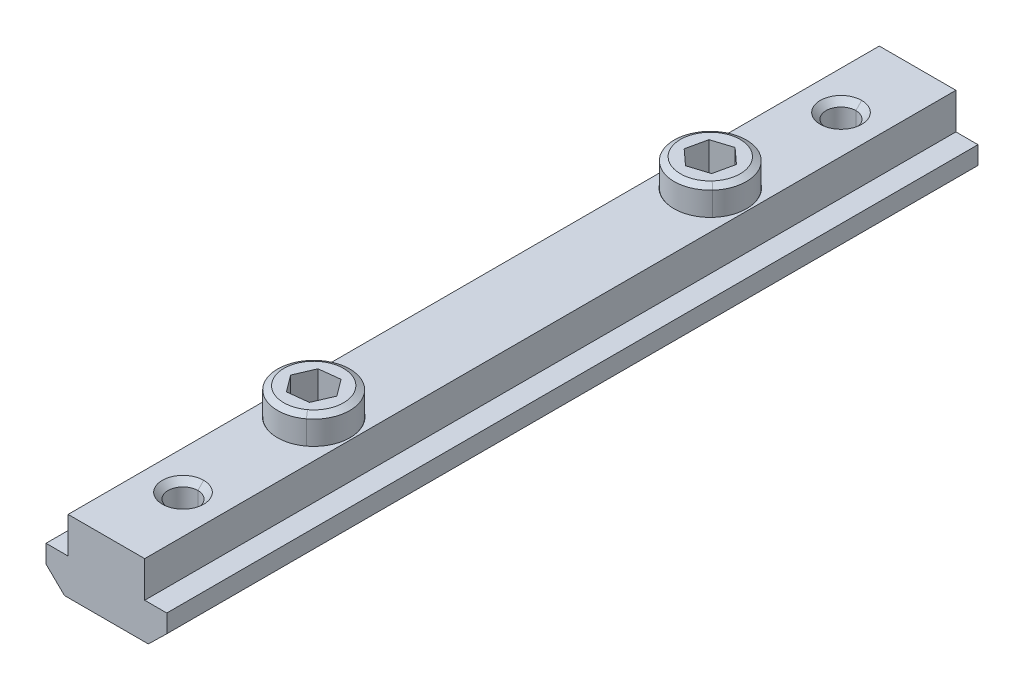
ISO-10303-21;
HEADER;
FILE_DESCRIPTION(('STEP AP214'),'2;1');
FILE_NAME('part.step','',(''),(''),'','','');
FILE_SCHEMA(('AUTOMOTIVE_DESIGN { 1 0 10303 214 1 1 1 1 }'));
ENDSEC;
DATA;
#1=APPLICATION_CONTEXT('core data for automotive mechanical design processes');
#2=APPLICATION_PROTOCOL_DEFINITION('international standard','automotive_design',2000,#1);
#3=PRODUCT_CONTEXT('',#1,'mechanical');
#4=PRODUCT('Part','Part','',(#3));
#5=PRODUCT_RELATED_PRODUCT_CATEGORY('part','',(#4));
#6=PRODUCT_DEFINITION_FORMATION('','',#4);
#7=PRODUCT_DEFINITION_CONTEXT('part definition',#1,'design');
#8=PRODUCT_DEFINITION('design','',#6,#7);
#9=PRODUCT_DEFINITION_SHAPE('','',#8);
#10=(LENGTH_UNIT() NAMED_UNIT(*) SI_UNIT(.MILLI.,.METRE.));
#11=(NAMED_UNIT(*) PLANE_ANGLE_UNIT() SI_UNIT($,.RADIAN.));
#12=(NAMED_UNIT(*) SI_UNIT($,.STERADIAN.) SOLID_ANGLE_UNIT());
#13=UNCERTAINTY_MEASURE_WITH_UNIT(LENGTH_MEASURE(1.E-05),#10,'distance_accuracy_value','');
#14=(GEOMETRIC_REPRESENTATION_CONTEXT(3) GLOBAL_UNCERTAINTY_ASSIGNED_CONTEXT((#13)) GLOBAL_UNIT_ASSIGNED_CONTEXT((#10,
#11,#12)) REPRESENTATION_CONTEXT('',''));
#15=CARTESIAN_POINT('',(0.,0.,0.));
#16=DIRECTION('',(0.,0.,1.));
#17=DIRECTION('',(1.,0.,0.));
#18=AXIS2_PLACEMENT_3D('',#15,#16,#17);
#19=CARTESIAN_POINT('',(2.29368657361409,-2.,21.7310478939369));
#20=DIRECTION('',(0.,-1.,0.));
#21=DIRECTION('',(0.,0.,-1.));
#22=AXIS2_PLACEMENT_3D('',#19,#20,#21);
#23=PLANE('',#22);
#24=DIRECTION('',(-0.395740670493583,0.,0.918362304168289));
#25=VECTOR('',#24,1.);
#26=CARTESIAN_POINT('',(2.29368657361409,-2.,21.7310478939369));
#27=LINE('',#26,#25);
#28=CARTESIAN_POINT('',(2.29368657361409,-2.,21.7310478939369));
#29=VERTEX_POINT('',#28);
#30=CARTESIAN_POINT('',(1.37976264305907,-2.,23.8519147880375));
#31=VERTEX_POINT('',#30);
#32=EDGE_CURVE('P0_E219',#29,#31,#27,.T.);
#33=ORIENTED_EDGE('',*,*,#32,.F.);
#34=DIRECTION('',(-0.59745475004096,0.,-0.801902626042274));
#35=VECTOR('',#34,1.);
#36=CARTESIAN_POINT('',(2.29368657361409,-2.,21.7310478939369));
#37=LINE('',#36,#35);
#38=CARTESIAN_POINT('',(0.91392393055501,-2.,19.8791331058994));
#39=VERTEX_POINT('',#38);
#40=EDGE_CURVE('P0_E11',#29,#39,#37,.T.);
#41=ORIENTED_EDGE('',*,*,#40,.T.);
#42=DIRECTION('',(-0.993195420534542,0.,0.116459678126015));
#43=VECTOR('',#42,1.);
#44=CARTESIAN_POINT('',(0.91392393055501,-2.,19.8791331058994));
#45=LINE('',#44,#43);
#46=CARTESIAN_POINT('',(-1.37976264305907,-2.,20.1480852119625));
#47=VERTEX_POINT('',#46);
#48=EDGE_CURVE('P0_E44',#39,#47,#45,.T.);
#49=ORIENTED_EDGE('',*,*,#48,.T.);
#50=DIRECTION('',(0.395740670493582,0.,-0.91836230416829));
#51=VECTOR('',#50,1.);
#52=CARTESIAN_POINT('',(-2.29368657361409,-2.,22.2689521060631));
#53=LINE('',#52,#51);
#54=CARTESIAN_POINT('',(-2.29368657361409,-2.,22.2689521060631));
#55=VERTEX_POINT('',#54);
#56=EDGE_CURVE('P0_E197',#55,#47,#53,.T.);
#57=ORIENTED_EDGE('',*,*,#56,.F.);
#58=DIRECTION('',(-0.597454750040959,0.,-0.801902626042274));
#59=VECTOR('',#58,1.);
#60=CARTESIAN_POINT('',(-0.913923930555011,-2.,24.1208668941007));
#61=LINE('',#60,#59);
#62=CARTESIAN_POINT('',(-0.913923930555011,-2.,24.1208668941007));
#63=VERTEX_POINT('',#62);
#64=EDGE_CURVE('P0_E232',#63,#55,#61,.T.);
#65=ORIENTED_EDGE('',*,*,#64,.F.);
#66=DIRECTION('',(0.993195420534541,0.,-0.116459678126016));
#67=VECTOR('',#66,1.);
#68=CARTESIAN_POINT('',(-0.913923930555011,-2.,24.1208668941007));
#69=LINE('',#68,#67);
#70=EDGE_CURVE('P0_E226',#63,#31,#69,.T.);
#71=ORIENTED_EDGE('',*,*,#70,.T.);
#72=EDGE_LOOP('',(#33,#41,#49,#57,#65,#71));
#73=FACE_BOUND('',#72,.T.);
#74=ADVANCED_FACE('P0_F17',(#73),#23,.F.);
#75=CARTESIAN_POINT('',(2.29368657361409,-2.,21.7310478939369));
#76=DIRECTION('',(0.801902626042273,0.,-0.59745475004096));
#77=DIRECTION('',(0.,-1.,0.));
#78=AXIS2_PLACEMENT_3D('',#75,#76,#77);
#79=PLANE('',#78);
#80=DIRECTION('',(-0.59745475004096,0.,-0.801902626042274));
#81=VECTOR('',#80,1.);
#82=CARTESIAN_POINT('',(2.29368657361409,3.,21.7310478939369));
#83=LINE('',#82,#81);
#84=CARTESIAN_POINT('',(2.29368657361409,3.,21.7310478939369));
#85=VERTEX_POINT('',#84);
#86=CARTESIAN_POINT('',(0.913923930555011,3.,19.8791331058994));
#87=VERTEX_POINT('',#86);
#88=EDGE_CURVE('P0_E192',#85,#87,#83,.T.);
#89=ORIENTED_EDGE('',*,*,#88,.T.);
#90=DIRECTION('',(0.,1.,0.));
#91=VECTOR('',#90,1.);
#92=CARTESIAN_POINT('',(0.91392393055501,-2.,19.8791331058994));
#93=LINE('',#92,#91);
#94=EDGE_CURVE('P0_E25',#39,#87,#93,.T.);
#95=ORIENTED_EDGE('',*,*,#94,.F.);
#96=ORIENTED_EDGE('',*,*,#40,.F.);
#97=DIRECTION('',(0.,1.,0.));
#98=VECTOR('',#97,1.);
#99=CARTESIAN_POINT('',(2.29368657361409,-2.,21.7310478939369));
#100=LINE('',#99,#98);
#101=EDGE_CURVE('P0_E133',#29,#85,#100,.T.);
#102=ORIENTED_EDGE('',*,*,#101,.T.);
#103=EDGE_LOOP('',(#89,#95,#96,#102));
#104=FACE_BOUND('',#103,.T.);
#105=ADVANCED_FACE('P0_F255',(#104),#79,.F.);
#106=CARTESIAN_POINT('',(0.91392393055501,-2.,19.8791331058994));
#107=DIRECTION('',(-0.116459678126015,0.,-0.993195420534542));
#108=DIRECTION('',(-0.993195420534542,0.,0.116459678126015));
#109=AXIS2_PLACEMENT_3D('',#106,#107,#108);
#110=PLANE('',#109);
#111=DIRECTION('',(-0.993195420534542,0.,0.116459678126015));
#112=VECTOR('',#111,1.);
#113=CARTESIAN_POINT('',(0.913923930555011,3.,19.8791331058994));
#114=LINE('',#113,#112);
#115=CARTESIAN_POINT('',(-1.37976264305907,3.,20.1480852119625));
#116=VERTEX_POINT('',#115);
#117=EDGE_CURVE('P0_E176',#87,#116,#114,.T.);
#118=ORIENTED_EDGE('',*,*,#117,.T.);
#119=DIRECTION('',(0.,1.,0.));
#120=VECTOR('',#119,1.);
#121=CARTESIAN_POINT('',(-1.37976264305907,-2.,20.1480852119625));
#122=LINE('',#121,#120);
#123=EDGE_CURVE('P0_E194',#47,#116,#122,.T.);
#124=ORIENTED_EDGE('',*,*,#123,.F.);
#125=ORIENTED_EDGE('',*,*,#48,.F.);
#126=ORIENTED_EDGE('',*,*,#94,.T.);
#127=EDGE_LOOP('',(#118,#124,#125,#126));
#128=FACE_BOUND('',#127,.T.);
#129=ADVANCED_FACE('P0_F248',(#128),#110,.F.);
#130=CARTESIAN_POINT('',(-2.29368657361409,-2.,22.2689521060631));
#131=DIRECTION('',(0.91836230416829,0.,0.395740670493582));
#132=DIRECTION('',(0.,-1.,0.));
#133=AXIS2_PLACEMENT_3D('',#130,#131,#132);
#134=PLANE('',#133);
#135=DIRECTION('',(0.395740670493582,0.,-0.91836230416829));
#136=VECTOR('',#135,1.);
#137=CARTESIAN_POINT('',(-2.29368657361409,3.,22.2689521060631));
#138=LINE('',#137,#136);
#139=CARTESIAN_POINT('',(-2.29368657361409,3.,22.2689521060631));
#140=VERTEX_POINT('',#139);
#141=EDGE_CURVE('P0_E168',#140,#116,#138,.T.);
#142=ORIENTED_EDGE('',*,*,#141,.F.);
#143=DIRECTION('',(0.,1.,0.));
#144=VECTOR('',#143,1.);
#145=CARTESIAN_POINT('',(-2.29368657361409,-2.,22.2689521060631));
#146=LINE('',#145,#144);
#147=EDGE_CURVE('P0_E236',#55,#140,#146,.T.);
#148=ORIENTED_EDGE('',*,*,#147,.F.);
#149=ORIENTED_EDGE('',*,*,#56,.T.);
#150=ORIENTED_EDGE('',*,*,#123,.T.);
#151=EDGE_LOOP('',(#142,#148,#149,#150));
#152=FACE_BOUND('',#151,.T.);
#153=ADVANCED_FACE('P0_F271',(#152),#134,.T.);
#154=CARTESIAN_POINT('',(-0.913923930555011,-2.,24.1208668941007));
#155=DIRECTION('',(0.801902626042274,0.,-0.597454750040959));
#156=DIRECTION('',(0.,-1.,0.));
#157=AXIS2_PLACEMENT_3D('',#154,#155,#156);
#158=PLANE('',#157);
#159=DIRECTION('',(-0.597454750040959,0.,-0.801902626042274));
#160=VECTOR('',#159,1.);
#161=CARTESIAN_POINT('',(-0.91392393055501,3.,24.1208668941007));
#162=LINE('',#161,#160);
#163=CARTESIAN_POINT('',(-0.91392393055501,3.,24.1208668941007));
#164=VERTEX_POINT('',#163);
#165=EDGE_CURVE('P0_E164',#164,#140,#162,.T.);
#166=ORIENTED_EDGE('',*,*,#165,.F.);
#167=DIRECTION('',(0.,1.,0.));
#168=VECTOR('',#167,1.);
#169=CARTESIAN_POINT('',(-0.913923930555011,-2.,24.1208668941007));
#170=LINE('',#169,#168);
#171=EDGE_CURVE('P0_E229',#63,#164,#170,.T.);
#172=ORIENTED_EDGE('',*,*,#171,.F.);
#173=ORIENTED_EDGE('',*,*,#64,.T.);
#174=ORIENTED_EDGE('',*,*,#147,.T.);
#175=EDGE_LOOP('',(#166,#172,#173,#174));
#176=FACE_BOUND('',#175,.T.);
#177=ADVANCED_FACE('P0_F268',(#176),#158,.T.);
#178=CARTESIAN_POINT('',(-0.913923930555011,-2.,24.1208668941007));
#179=DIRECTION('',(0.116459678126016,0.,0.993195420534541));
#180=DIRECTION('',(0.,-1.,0.));
#181=AXIS2_PLACEMENT_3D('',#178,#179,#180);
#182=PLANE('',#181);
#183=DIRECTION('',(0.993195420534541,0.,-0.116459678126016));
#184=VECTOR('',#183,1.);
#185=CARTESIAN_POINT('',(-0.91392393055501,3.,24.1208668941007));
#186=LINE('',#185,#184);
#187=CARTESIAN_POINT('',(1.37976264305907,3.,23.8519147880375));
#188=VERTEX_POINT('',#187);
#189=EDGE_CURVE('P0_E169',#164,#188,#186,.T.);
#190=ORIENTED_EDGE('',*,*,#189,.T.);
#191=DIRECTION('',(0.,1.,0.));
#192=VECTOR('',#191,1.);
#193=CARTESIAN_POINT('',(1.37976264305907,-2.,23.8519147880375));
#194=LINE('',#193,#192);
#195=EDGE_CURVE('P0_E223',#31,#188,#194,.T.);
#196=ORIENTED_EDGE('',*,*,#195,.F.);
#197=ORIENTED_EDGE('',*,*,#70,.F.);
#198=ORIENTED_EDGE('',*,*,#171,.T.);
#199=EDGE_LOOP('',(#190,#196,#197,#198));
#200=FACE_BOUND('',#199,.T.);
#201=ADVANCED_FACE('P0_F264',(#200),#182,.F.);
#202=CARTESIAN_POINT('',(2.29368657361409,-2.,21.7310478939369));
#203=DIRECTION('',(-0.91836230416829,0.,-0.395740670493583));
#204=DIRECTION('',(-0.395740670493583,0.,0.91836230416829));
#205=AXIS2_PLACEMENT_3D('',#202,#203,#204);
#206=PLANE('',#205);
#207=DIRECTION('',(-0.395740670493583,0.,0.918362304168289));
#208=VECTOR('',#207,1.);
#209=CARTESIAN_POINT('',(2.29368657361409,3.,21.7310478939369));
#210=LINE('',#209,#208);
#211=EDGE_CURVE('P0_E182',#85,#188,#210,.T.);
#212=ORIENTED_EDGE('',*,*,#211,.F.);
#213=ORIENTED_EDGE('',*,*,#101,.F.);
#214=ORIENTED_EDGE('',*,*,#32,.T.);
#215=ORIENTED_EDGE('',*,*,#195,.T.);
#216=EDGE_LOOP('',(#212,#213,#214,#215));
#217=FACE_BOUND('',#216,.T.);
#218=ADVANCED_FACE('P0_F259',(#217),#206,.T.);
#219=CARTESIAN_POINT('',(0.,3.,22.));
#220=DIRECTION('',(0.,-1.,0.));
#221=DIRECTION('',(-0.597454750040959,0.,-0.801902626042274));
#222=AXIS2_PLACEMENT_3D('',#219,#220,#221);
#223=CONICAL_SURFACE('',#222,3.3095,1.0471975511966);
#224=DIRECTION('',(0.517410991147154,-0.5,0.694468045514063));
#225=VECTOR('',#224,1.);
#226=CARTESIAN_POINT('',(1.97727649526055,3.,24.6538967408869));
#227=LINE('',#226,#225);
#228=CARTESIAN_POINT('',(1.97727649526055,3.,24.6538967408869));
#229=VERTEX_POINT('',#228);
#230=CARTESIAN_POINT('',(2.38981900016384,2.60133963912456,25.2076105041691));
#231=VERTEX_POINT('',#230);
#232=EDGE_CURVE('P0_E124',#229,#231,#227,.T.);
#233=ORIENTED_EDGE('',*,*,#232,.F.);
#234=CARTESIAN_POINT('',(0.,3.,22.));
#235=DIRECTION('',(0.,1.,0.));
#236=DIRECTION('',(0.597454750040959,0.,0.801902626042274));
#237=AXIS2_PLACEMENT_3D('',#234,#235,#236);
#238=CIRCLE('',#237,3.3095);
#239=CARTESIAN_POINT('',(-1.97727649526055,3.,19.3461032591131));
#240=VERTEX_POINT('',#239);
#241=EDGE_CURVE('P0_E189',#240,#229,#238,.T.);
#242=ORIENTED_EDGE('',*,*,#241,.F.);
#243=DIRECTION('',(-0.517410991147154,-0.5,-0.694468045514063));
#244=VECTOR('',#243,1.);
#245=CARTESIAN_POINT('',(-1.97727649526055,3.,19.3461032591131));
#246=LINE('',#245,#244);
#247=CARTESIAN_POINT('',(-2.38981900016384,2.60133963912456,18.7923894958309));
#248=VERTEX_POINT('',#247);
#249=EDGE_CURVE('P0_E127',#240,#248,#246,.T.);
#250=ORIENTED_EDGE('',*,*,#249,.T.);
#251=CARTESIAN_POINT('',(0.,2.60133963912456,22.));
#252=DIRECTION('',(0.,1.,0.));
#253=DIRECTION('',(0.597454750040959,0.,0.801902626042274));
#254=AXIS2_PLACEMENT_3D('',#251,#252,#253);
#255=CIRCLE('',#254,4.);
#256=EDGE_CURVE('P0_E120',#248,#231,#255,.T.);
#257=ORIENTED_EDGE('',*,*,#256,.T.);
#258=EDGE_LOOP('',(#233,#242,#250,#257));
#259=FACE_BOUND('',#258,.T.);
#260=ADVANCED_FACE('P0_F122',(#259),#223,.T.);
#261=CARTESIAN_POINT('',(0.,15.7,22.));
#262=DIRECTION('',(0.,1.,0.));
#263=DIRECTION('',(0.597454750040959,0.,0.801902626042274));
#264=AXIS2_PLACEMENT_3D('',#261,#262,#263);
#265=CYLINDRICAL_SURFACE('',#264,4.);
#266=DIRECTION('',(0.,1.,0.));
#267=VECTOR('',#266,1.);
#268=CARTESIAN_POINT('',(-2.38981900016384,15.7,18.7923894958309));
#269=LINE('',#268,#267);
#270=CARTESIAN_POINT('',(-2.38981900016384,-5.7,18.7923894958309));
#271=VERTEX_POINT('',#270);
#272=EDGE_CURVE('P0_E146',#271,#248,#269,.T.);
#273=ORIENTED_EDGE('',*,*,#272,.F.);
#274=CARTESIAN_POINT('',(0.,-5.7,22.));
#275=DIRECTION('',(0.,1.,0.));
#276=DIRECTION('',(0.597454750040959,0.,0.801902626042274));
#277=AXIS2_PLACEMENT_3D('',#274,#275,#276);
#278=CIRCLE('',#277,4.);
#279=CARTESIAN_POINT('',(2.38981900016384,-5.7,25.2076105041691));
#280=VERTEX_POINT('',#279);
#281=EDGE_CURVE('P0_E134',#271,#280,#278,.T.);
#282=ORIENTED_EDGE('',*,*,#281,.T.);
#283=DIRECTION('',(0.,1.,0.));
#284=VECTOR('',#283,1.);
#285=CARTESIAN_POINT('',(2.38981900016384,15.7,25.2076105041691));
#286=LINE('',#285,#284);
#287=EDGE_CURVE('P0_E137',#280,#231,#286,.T.);
#288=ORIENTED_EDGE('',*,*,#287,.T.);
#289=ORIENTED_EDGE('',*,*,#256,.F.);
#290=EDGE_LOOP('',(#273,#282,#288,#289));
#291=FACE_BOUND('',#290,.T.);
#292=ADVANCED_FACE('P0_F139',(#291),#265,.T.);
#293=CARTESIAN_POINT('',(0.,-5.7,22.));
#294=DIRECTION('',(0.,1.,0.));
#295=DIRECTION('',(0.597454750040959,0.,0.801902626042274));
#296=AXIS2_PLACEMENT_3D('',#293,#294,#295);
#297=CONICAL_SURFACE('',#296,4.,0.785398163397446);
#298=DIRECTION('',(-0.422464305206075,0.70710678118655,-0.56703078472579));
#299=VECTOR('',#298,1.);
#300=CARTESIAN_POINT('',(-2.38981900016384,-5.7,18.7923894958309));
#301=LINE('',#300,#299);
#302=CARTESIAN_POINT('',(-0.418218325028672,-9.,21.4386681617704));
#303=VERTEX_POINT('',#302);
#304=EDGE_CURVE('P0_E188',#303,#271,#301,.T.);
#305=ORIENTED_EDGE('',*,*,#304,.F.);
#306=CARTESIAN_POINT('',(0.,-9.,22.));
#307=DIRECTION('',(0.,1.,0.));
#308=DIRECTION('',(0.597454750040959,0.,0.801902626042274));
#309=AXIS2_PLACEMENT_3D('',#306,#307,#308);
#310=CIRCLE('',#309,0.7);
#311=CARTESIAN_POINT('',(0.41821832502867,-9.,22.5613318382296));
#312=VERTEX_POINT('',#311);
#313=EDGE_CURVE('P0_E212',#303,#312,#310,.T.);
#314=ORIENTED_EDGE('',*,*,#313,.T.);
#315=DIRECTION('',(0.422464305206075,0.707106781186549,0.567030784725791));
#316=VECTOR('',#315,1.);
#317=CARTESIAN_POINT('',(2.38981900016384,-5.7,25.2076105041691));
#318=LINE('',#317,#316);
#319=EDGE_CURVE('P0_E193',#312,#280,#318,.T.);
#320=ORIENTED_EDGE('',*,*,#319,.T.);
#321=ORIENTED_EDGE('',*,*,#281,.F.);
#322=EDGE_LOOP('',(#305,#314,#320,#321));
#323=FACE_BOUND('',#322,.T.);
#324=ADVANCED_FACE('P0_F288',(#323),#297,.T.);
#325=CARTESIAN_POINT('',(0.561331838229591,-9.,21.5817816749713));
#326=DIRECTION('',(0.,-1.,0.));
#327=DIRECTION('',(0.,0.,-1.));
#328=AXIS2_PLACEMENT_3D('',#325,#326,#327);
#329=PLANE('',#328);
#330=CARTESIAN_POINT('',(0.,-9.,22.));
#331=DIRECTION('',(0.,1.,0.));
#332=DIRECTION('',(0.597454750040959,0.,0.801902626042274));
#333=AXIS2_PLACEMENT_3D('',#330,#331,#332);
#334=CIRCLE('',#333,0.7);
#335=EDGE_CURVE('P0_E145',#312,#303,#334,.T.);
#336=ORIENTED_EDGE('',*,*,#335,.F.);
#337=ORIENTED_EDGE('',*,*,#313,.F.);
#338=EDGE_LOOP('',(#336,#337));
#339=FACE_BOUND('',#338,.T.);
#340=ADVANCED_FACE('P0_F291',(#339),#329,.T.);
#341=CARTESIAN_POINT('',(0.,3.,22.));
#342=DIRECTION('',(0.,1.,0.));
#343=DIRECTION('',(0.,0.,-1.));
#344=AXIS2_PLACEMENT_3D('',#341,#342,#343);
#345=PLANE('',#344);
#346=ORIENTED_EDGE('',*,*,#88,.F.);
#347=ORIENTED_EDGE('',*,*,#211,.T.);
#348=ORIENTED_EDGE('',*,*,#189,.F.);
#349=ORIENTED_EDGE('',*,*,#165,.T.);
#350=ORIENTED_EDGE('',*,*,#141,.T.);
#351=ORIENTED_EDGE('',*,*,#117,.F.);
#352=EDGE_LOOP('',(#346,#347,#348,#349,#350,#351));
#353=FACE_BOUND('',#352,.T.);
#354=ORIENTED_EDGE('',*,*,#241,.T.);
#355=CARTESIAN_POINT('',(0.,3.,22.));
#356=DIRECTION('',(0.,1.,0.));
#357=DIRECTION('',(0.597454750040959,0.,0.801902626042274));
#358=AXIS2_PLACEMENT_3D('',#355,#356,#357);
#359=CIRCLE('',#358,3.3095);
#360=EDGE_CURVE('P0_E155',#229,#240,#359,.T.);
#361=ORIENTED_EDGE('',*,*,#360,.T.);
#362=EDGE_LOOP('',(#354,#361));
#363=FACE_BOUND('',#362,.T.);
#364=ADVANCED_FACE('P0_F252',(#353,#363),#345,.T.);
#365=CARTESIAN_POINT('',(0.,-5.7,22.));
#366=DIRECTION('',(0.,1.,0.));
#367=DIRECTION('',(0.597454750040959,0.,0.801902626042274));
#368=AXIS2_PLACEMENT_3D('',#365,#366,#367);
#369=CONICAL_SURFACE('',#368,4.,0.785398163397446);
#370=ORIENTED_EDGE('',*,*,#335,.T.);
#371=ORIENTED_EDGE('',*,*,#304,.T.);
#372=CARTESIAN_POINT('',(0.,-5.7,22.));
#373=DIRECTION('',(0.,1.,0.));
#374=DIRECTION('',(0.597454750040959,0.,0.801902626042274));
#375=AXIS2_PLACEMENT_3D('',#372,#373,#374);
#376=CIRCLE('',#375,4.);
#377=EDGE_CURVE('P0_E170',#280,#271,#376,.T.);
#378=ORIENTED_EDGE('',*,*,#377,.F.);
#379=ORIENTED_EDGE('',*,*,#319,.F.);
#380=EDGE_LOOP('',(#370,#371,#378,#379));
#381=FACE_BOUND('',#380,.T.);
#382=ADVANCED_FACE('P0_F296',(#381),#369,.T.);
#383=CARTESIAN_POINT('',(0.,15.7,22.));
#384=DIRECTION('',(0.,1.,0.));
#385=DIRECTION('',(0.597454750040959,0.,0.801902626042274));
#386=AXIS2_PLACEMENT_3D('',#383,#384,#385);
#387=CYLINDRICAL_SURFACE('',#386,4.);
#388=ORIENTED_EDGE('',*,*,#377,.T.);
#389=ORIENTED_EDGE('',*,*,#272,.T.);
#390=CARTESIAN_POINT('',(0.,2.60133963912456,22.));
#391=DIRECTION('',(0.,1.,0.));
#392=DIRECTION('',(0.597454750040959,0.,0.801902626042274));
#393=AXIS2_PLACEMENT_3D('',#390,#391,#392);
#394=CIRCLE('',#393,4.);
#395=EDGE_CURVE('P0_E148',#231,#248,#394,.T.);
#396=ORIENTED_EDGE('',*,*,#395,.F.);
#397=ORIENTED_EDGE('',*,*,#287,.F.);
#398=EDGE_LOOP('',(#388,#389,#396,#397));
#399=FACE_BOUND('',#398,.T.);
#400=ADVANCED_FACE('P0_F149',(#399),#387,.T.);
#401=CARTESIAN_POINT('',(0.,3.,22.));
#402=DIRECTION('',(0.,-1.,0.));
#403=DIRECTION('',(-0.597454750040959,0.,-0.801902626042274));
#404=AXIS2_PLACEMENT_3D('',#401,#402,#403);
#405=CONICAL_SURFACE('',#404,3.3095,1.0471975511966);
#406=ORIENTED_EDGE('',*,*,#360,.F.);
#407=ORIENTED_EDGE('',*,*,#232,.T.);
#408=ORIENTED_EDGE('',*,*,#395,.T.);
#409=ORIENTED_EDGE('',*,*,#249,.F.);
#410=EDGE_LOOP('',(#406,#407,#408,#409));
#411=FACE_BOUND('',#410,.T.);
#412=ADVANCED_FACE('P0_F153',(#411),#405,.T.);
#413=CLOSED_SHELL('',(#74,#105,#129,#153,#177,#201,#218,#260,#292,#324,#340,#364,#382,#400,#412));
#414=MANIFOLD_SOLID_BREP('P0_B1',#413);
#415=CARTESIAN_POINT('',(2.20190261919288,-2.,-22.6963893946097));
#416=DIRECTION('',(0.,-1.,0.));
#417=DIRECTION('',(-1.,0.,0.));
#418=AXIS2_PLACEMENT_3D('',#415,#416,#417);
#419=PLANE('',#418);
#420=DIRECTION('',(-0.215579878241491,0.,0.976486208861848));
#421=VECTOR('',#420,1.);
#422=CARTESIAN_POINT('',(2.20190261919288,-2.,-22.6963893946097));
#423=LINE('',#422,#421);
#424=CARTESIAN_POINT('',(2.20190261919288,-2.,-22.6963893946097));
#425=VERTEX_POINT('',#424);
#426=CARTESIAN_POINT('',(1.70404221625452,-2.,-20.4412910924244));
#427=VERTEX_POINT('',#426);
#428=EDGE_CURVE('P1_E211',#425,#427,#423,.T.);
#429=ORIENTED_EDGE('',*,*,#428,.F.);
#430=DIRECTION('',(-0.737871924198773,0.,-0.67494075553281));
#431=VECTOR('',#430,1.);
#432=CARTESIAN_POINT('',(2.20190261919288,-2.,-22.6963893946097));
#433=LINE('',#432,#431);
#434=CARTESIAN_POINT('',(0.497860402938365,-2.,-24.2550983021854));
#435=VERTEX_POINT('',#434);
#436=EDGE_CURVE('P1_E11',#425,#435,#433,.T.);
#437=ORIENTED_EDGE('',*,*,#436,.T.);
#438=DIRECTION('',(-0.953451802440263,0.,0.301545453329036));
#439=VECTOR('',#438,1.);
#440=CARTESIAN_POINT('',(0.497860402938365,-2.,-24.2550983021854));
#441=LINE('',#440,#439);
#442=CARTESIAN_POINT('',(-1.70404221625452,-2.,-23.5587089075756));
#443=VERTEX_POINT('',#442);
#444=EDGE_CURVE('P1_E45',#435,#443,#441,.T.);
#445=ORIENTED_EDGE('',*,*,#444,.T.);
#446=DIRECTION('',(0.21557987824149,0.,-0.976486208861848));
#447=VECTOR('',#446,1.);
#448=CARTESIAN_POINT('',(-2.20190261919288,-2.,-21.3036106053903));
#449=LINE('',#448,#447);
#450=CARTESIAN_POINT('',(-2.20190261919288,-2.,-21.3036106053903));
#451=VERTEX_POINT('',#450);
#452=EDGE_CURVE('P1_E226',#451,#443,#449,.T.);
#453=ORIENTED_EDGE('',*,*,#452,.F.);
#454=DIRECTION('',(-0.737871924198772,0.,-0.674940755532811));
#455=VECTOR('',#454,1.);
#456=CARTESIAN_POINT('',(-0.497860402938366,-2.,-19.7449016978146));
#457=LINE('',#456,#455);
#458=CARTESIAN_POINT('',(-0.497860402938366,-2.,-19.7449016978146));
#459=VERTEX_POINT('',#458);
#460=EDGE_CURVE('P1_E212',#459,#451,#457,.T.);
#461=ORIENTED_EDGE('',*,*,#460,.F.);
#462=DIRECTION('',(0.953451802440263,0.,-0.301545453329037));
#463=VECTOR('',#462,1.);
#464=CARTESIAN_POINT('',(-0.497860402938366,-2.,-19.7449016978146));
#465=LINE('',#464,#463);
#466=EDGE_CURVE('P1_E181',#459,#427,#465,.T.);
#467=ORIENTED_EDGE('',*,*,#466,.T.);
#468=EDGE_LOOP('',(#429,#437,#445,#453,#461,#467));
#469=FACE_BOUND('',#468,.T.);
#470=ADVANCED_FACE('P1_F17',(#469),#419,.F.);
#471=CARTESIAN_POINT('',(2.20190261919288,-2.,-22.6963893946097));
#472=DIRECTION('',(0.67494075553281,0.,-0.737871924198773));
#473=DIRECTION('',(0.,-1.,0.));
#474=AXIS2_PLACEMENT_3D('',#471,#472,#473);
#475=PLANE('',#474);
#476=DIRECTION('',(-0.737871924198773,0.,-0.67494075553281));
#477=VECTOR('',#476,1.);
#478=CARTESIAN_POINT('',(2.20190261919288,3.,-22.6963893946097));
#479=LINE('',#478,#477);
#480=CARTESIAN_POINT('',(2.20190261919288,3.,-22.6963893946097));
#481=VERTEX_POINT('',#480);
#482=CARTESIAN_POINT('',(0.497860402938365,3.,-24.2550983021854));
#483=VERTEX_POINT('',#482);
#484=EDGE_CURVE('P1_E188',#481,#483,#479,.T.);
#485=ORIENTED_EDGE('',*,*,#484,.T.);
#486=DIRECTION('',(0.,1.,0.));
#487=VECTOR('',#486,1.);
#488=CARTESIAN_POINT('',(0.497860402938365,-2.,-24.2550983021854));
#489=LINE('',#488,#487);
#490=EDGE_CURVE('P1_E26',#435,#483,#489,.T.);
#491=ORIENTED_EDGE('',*,*,#490,.F.);
#492=ORIENTED_EDGE('',*,*,#436,.F.);
#493=DIRECTION('',(0.,1.,0.));
#494=VECTOR('',#493,1.);
#495=CARTESIAN_POINT('',(2.20190261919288,-2.,-22.6963893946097));
#496=LINE('',#495,#494);
#497=EDGE_CURVE('P1_E208',#425,#481,#496,.T.);
#498=ORIENTED_EDGE('',*,*,#497,.T.);
#499=EDGE_LOOP('',(#485,#491,#492,#498));
#500=FACE_BOUND('',#499,.T.);
#501=ADVANCED_FACE('P1_F19',(#500),#475,.F.);
#502=CARTESIAN_POINT('',(0.497860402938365,-2.,-24.2550983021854));
#503=DIRECTION('',(-0.301545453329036,0.,-0.953451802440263));
#504=DIRECTION('',(-0.953451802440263,0.,0.301545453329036));
#505=AXIS2_PLACEMENT_3D('',#502,#503,#504);
#506=PLANE('',#505);
#507=DIRECTION('',(-0.953451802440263,0.,0.301545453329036));
#508=VECTOR('',#507,1.);
#509=CARTESIAN_POINT('',(0.497860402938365,3.,-24.2550983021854));
#510=LINE('',#509,#508);
#511=CARTESIAN_POINT('',(-1.70404221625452,3.,-23.5587089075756));
#512=VERTEX_POINT('',#511);
#513=EDGE_CURVE('P1_E166',#483,#512,#510,.T.);
#514=ORIENTED_EDGE('',*,*,#513,.T.);
#515=DIRECTION('',(0.,1.,0.));
#516=VECTOR('',#515,1.);
#517=CARTESIAN_POINT('',(-1.70404221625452,-2.,-23.5587089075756));
#518=LINE('',#517,#516);
#519=EDGE_CURVE('P1_E230',#443,#512,#518,.T.);
#520=ORIENTED_EDGE('',*,*,#519,.F.);
#521=ORIENTED_EDGE('',*,*,#444,.F.);
#522=ORIENTED_EDGE('',*,*,#490,.T.);
#523=EDGE_LOOP('',(#514,#520,#521,#522));
#524=FACE_BOUND('',#523,.T.);
#525=ADVANCED_FACE('P1_F240',(#524),#506,.F.);
#526=CARTESIAN_POINT('',(-2.20190261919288,-2.,-21.3036106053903));
#527=DIRECTION('',(0.976486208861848,0.,0.21557987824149));
#528=DIRECTION('',(0.,-1.,0.));
#529=AXIS2_PLACEMENT_3D('',#526,#527,#528);
#530=PLANE('',#529);
#531=DIRECTION('',(0.21557987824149,0.,-0.976486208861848));
#532=VECTOR('',#531,1.);
#533=CARTESIAN_POINT('',(-2.20190261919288,3.,-21.3036106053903));
#534=LINE('',#533,#532);
#535=CARTESIAN_POINT('',(-2.20190261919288,3.,-21.3036106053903));
#536=VERTEX_POINT('',#535);
#537=EDGE_CURVE('P1_E197',#536,#512,#534,.T.);
#538=ORIENTED_EDGE('',*,*,#537,.F.);
#539=DIRECTION('',(0.,1.,0.));
#540=VECTOR('',#539,1.);
#541=CARTESIAN_POINT('',(-2.20190261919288,-2.,-21.3036106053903));
#542=LINE('',#541,#540);
#543=EDGE_CURVE('P1_E216',#451,#536,#542,.T.);
#544=ORIENTED_EDGE('',*,*,#543,.F.);
#545=ORIENTED_EDGE('',*,*,#452,.T.);
#546=ORIENTED_EDGE('',*,*,#519,.T.);
#547=EDGE_LOOP('',(#538,#544,#545,#546));
#548=FACE_BOUND('',#547,.T.);
#549=ADVANCED_FACE('P1_F263',(#548),#530,.T.);
#550=CARTESIAN_POINT('',(-0.497860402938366,-2.,-19.7449016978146));
#551=DIRECTION('',(0.674940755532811,0.,-0.737871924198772));
#552=DIRECTION('',(0.,-1.,0.));
#553=AXIS2_PLACEMENT_3D('',#550,#551,#552);
#554=PLANE('',#553);
#555=DIRECTION('',(-0.737871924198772,0.,-0.674940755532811));
#556=VECTOR('',#555,1.);
#557=CARTESIAN_POINT('',(-0.497860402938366,3.,-19.7449016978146));
#558=LINE('',#557,#556);
#559=CARTESIAN_POINT('',(-0.497860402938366,3.,-19.7449016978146));
#560=VERTEX_POINT('',#559);
#561=EDGE_CURVE('P1_E179',#560,#536,#558,.T.);
#562=ORIENTED_EDGE('',*,*,#561,.F.);
#563=DIRECTION('',(0.,1.,0.));
#564=VECTOR('',#563,1.);
#565=CARTESIAN_POINT('',(-0.497860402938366,-2.,-19.7449016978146));
#566=LINE('',#565,#564);
#567=EDGE_CURVE('P1_E184',#459,#560,#566,.T.);
#568=ORIENTED_EDGE('',*,*,#567,.F.);
#569=ORIENTED_EDGE('',*,*,#460,.T.);
#570=ORIENTED_EDGE('',*,*,#543,.T.);
#571=EDGE_LOOP('',(#562,#568,#569,#570));
#572=FACE_BOUND('',#571,.T.);
#573=ADVANCED_FACE('P1_F260',(#572),#554,.T.);
#574=CARTESIAN_POINT('',(-0.497860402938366,-2.,-19.7449016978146));
#575=DIRECTION('',(0.301545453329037,0.,0.953451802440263));
#576=DIRECTION('',(0.,-1.,0.));
#577=AXIS2_PLACEMENT_3D('',#574,#575,#576);
#578=PLANE('',#577);
#579=DIRECTION('',(0.953451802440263,0.,-0.301545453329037));
#580=VECTOR('',#579,1.);
#581=CARTESIAN_POINT('',(-0.497860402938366,3.,-19.7449016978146));
#582=LINE('',#581,#580);
#583=CARTESIAN_POINT('',(1.70404221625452,3.,-20.4412910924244));
#584=VERTEX_POINT('',#583);
#585=EDGE_CURVE('P1_E175',#560,#584,#582,.T.);
#586=ORIENTED_EDGE('',*,*,#585,.T.);
#587=DIRECTION('',(0.,1.,0.));
#588=VECTOR('',#587,1.);
#589=CARTESIAN_POINT('',(1.70404221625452,-2.,-20.4412910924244));
#590=LINE('',#589,#588);
#591=EDGE_CURVE('P1_E185',#427,#584,#590,.T.);
#592=ORIENTED_EDGE('',*,*,#591,.F.);
#593=ORIENTED_EDGE('',*,*,#466,.F.);
#594=ORIENTED_EDGE('',*,*,#567,.T.);
#595=EDGE_LOOP('',(#586,#592,#593,#594));
#596=FACE_BOUND('',#595,.T.);
#597=ADVANCED_FACE('P1_F256',(#596),#578,.F.);
#598=CARTESIAN_POINT('',(2.20190261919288,-2.,-22.6963893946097));
#599=DIRECTION('',(-0.976486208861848,0.,-0.215579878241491));
#600=DIRECTION('',(-0.215579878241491,0.,0.976486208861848));
#601=AXIS2_PLACEMENT_3D('',#598,#599,#600);
#602=PLANE('',#601);
#603=DIRECTION('',(-0.215579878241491,0.,0.976486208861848));
#604=VECTOR('',#603,1.);
#605=CARTESIAN_POINT('',(2.20190261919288,3.,-22.6963893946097));
#606=LINE('',#605,#604);
#607=EDGE_CURVE('P1_E180',#481,#584,#606,.T.);
#608=ORIENTED_EDGE('',*,*,#607,.F.);
#609=ORIENTED_EDGE('',*,*,#497,.F.);
#610=ORIENTED_EDGE('',*,*,#428,.T.);
#611=ORIENTED_EDGE('',*,*,#591,.T.);
#612=EDGE_LOOP('',(#608,#609,#610,#611));
#613=FACE_BOUND('',#612,.T.);
#614=ADVANCED_FACE('P1_F251',(#613),#602,.T.);
#615=CARTESIAN_POINT('',(0.,3.,-22.));
#616=DIRECTION('',(0.,-1.,0.));
#617=DIRECTION('',(-0.737871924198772,0.,-0.674940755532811));
#618=AXIS2_PLACEMENT_3D('',#615,#616,#617);
#619=CONICAL_SURFACE('',#618,3.3095,1.0471975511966);
#620=DIRECTION('',(0.639015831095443,-0.5,0.584515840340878));
#621=VECTOR('',#620,1.);
#622=CARTESIAN_POINT('',(2.44198713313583,3.,-19.7662835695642));
#623=LINE('',#622,#621);
#624=CARTESIAN_POINT('',(2.44198713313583,3.,-19.7662835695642));
#625=VERTEX_POINT('',#624);
#626=CARTESIAN_POINT('',(2.95148769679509,2.60133963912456,-19.3002369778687));
#627=VERTEX_POINT('',#626);
#628=EDGE_CURVE('P1_E171',#625,#627,#623,.T.);
#629=ORIENTED_EDGE('',*,*,#628,.F.);
#630=CARTESIAN_POINT('',(0.,3.,-22.));
#631=DIRECTION('',(0.,1.,0.));
#632=DIRECTION('',(0.737871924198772,0.,0.674940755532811));
#633=AXIS2_PLACEMENT_3D('',#630,#631,#632);
#634=CIRCLE('',#633,3.3095);
#635=CARTESIAN_POINT('',(-2.44198713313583,3.,-24.2337164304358));
#636=VERTEX_POINT('',#635);
#637=EDGE_CURVE('P1_E173',#636,#625,#634,.T.);
#638=ORIENTED_EDGE('',*,*,#637,.F.);
#639=DIRECTION('',(-0.639015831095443,-0.5,-0.584515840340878));
#640=VECTOR('',#639,1.);
#641=CARTESIAN_POINT('',(-2.44198713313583,3.,-24.2337164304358));
#642=LINE('',#641,#640);
#643=CARTESIAN_POINT('',(-2.95148769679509,2.60133963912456,-24.6997630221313));
#644=VERTEX_POINT('',#643);
#645=EDGE_CURVE('P1_E156',#636,#644,#642,.T.);
#646=ORIENTED_EDGE('',*,*,#645,.T.);
#647=CARTESIAN_POINT('',(0.,2.60133963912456,-22.));
#648=DIRECTION('',(0.,1.,0.));
#649=DIRECTION('',(0.737871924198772,0.,0.674940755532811));
#650=AXIS2_PLACEMENT_3D('',#647,#648,#649);
#651=CIRCLE('',#650,4.);
#652=EDGE_CURVE('P1_E133',#644,#627,#651,.T.);
#653=ORIENTED_EDGE('',*,*,#652,.T.);
#654=EDGE_LOOP('',(#629,#638,#646,#653));
#655=FACE_BOUND('',#654,.T.);
#656=ADVANCED_FACE('P1_F278',(#655),#619,.T.);
#657=CARTESIAN_POINT('',(0.,15.7,-22.));
#658=DIRECTION('',(0.,1.,0.));
#659=DIRECTION('',(0.737871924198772,0.,0.674940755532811));
#660=AXIS2_PLACEMENT_3D('',#657,#658,#659);
#661=CYLINDRICAL_SURFACE('',#660,4.);
#662=DIRECTION('',(0.,1.,0.));
#663=VECTOR('',#662,1.);
#664=CARTESIAN_POINT('',(-2.95148769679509,15.7,-24.6997630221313));
#665=LINE('',#664,#663);
#666=CARTESIAN_POINT('',(-2.95148769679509,-5.7,-24.6997630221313));
#667=VERTEX_POINT('',#666);
#668=EDGE_CURVE('P1_E146',#667,#644,#665,.T.);
#669=ORIENTED_EDGE('',*,*,#668,.F.);
#670=CARTESIAN_POINT('',(0.,-5.7,-22.));
#671=DIRECTION('',(0.,1.,0.));
#672=DIRECTION('',(0.737871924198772,0.,0.674940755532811));
#673=AXIS2_PLACEMENT_3D('',#670,#671,#672);
#674=CIRCLE('',#673,4.);
#675=CARTESIAN_POINT('',(2.95148769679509,-5.7,-19.3002369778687));
#676=VERTEX_POINT('',#675);
#677=EDGE_CURVE('P1_E121',#667,#676,#674,.T.);
#678=ORIENTED_EDGE('',*,*,#677,.T.);
#679=DIRECTION('',(0.,1.,0.));
#680=VECTOR('',#679,1.);
#681=CARTESIAN_POINT('',(2.95148769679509,15.7,-19.3002369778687));
#682=LINE('',#681,#680);
#683=EDGE_CURVE('P1_E152',#676,#627,#682,.T.);
#684=ORIENTED_EDGE('',*,*,#683,.T.);
#685=ORIENTED_EDGE('',*,*,#652,.F.);
#686=EDGE_LOOP('',(#669,#678,#684,#685));
#687=FACE_BOUND('',#686,.T.);
#688=ADVANCED_FACE('P1_F147',(#687),#661,.T.);
#689=CARTESIAN_POINT('',(0.,-5.7,-22.));
#690=DIRECTION('',(0.,1.,0.));
#691=DIRECTION('',(0.737871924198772,0.,0.674940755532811));
#692=AXIS2_PLACEMENT_3D('',#689,#690,#691);
#693=CONICAL_SURFACE('',#692,4.,0.785398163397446);
#694=DIRECTION('',(-0.521754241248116,0.70710678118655,-0.477255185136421));
#695=VECTOR('',#694,1.);
#696=CARTESIAN_POINT('',(-2.95148769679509,-5.7,-24.6997630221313));
#697=LINE('',#696,#695);
#698=CARTESIAN_POINT('',(-0.516510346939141,-9.,-22.4724585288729));
#699=VERTEX_POINT('',#698);
#700=EDGE_CURVE('P1_E124',#699,#667,#697,.T.);
#701=ORIENTED_EDGE('',*,*,#700,.F.);
#702=CARTESIAN_POINT('',(0.,-9.,-22.));
#703=DIRECTION('',(0.,1.,0.));
#704=DIRECTION('',(0.737871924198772,0.,0.674940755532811));
#705=AXIS2_PLACEMENT_3D('',#702,#703,#704);
#706=CIRCLE('',#705,0.7);
#707=CARTESIAN_POINT('',(0.516510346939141,-9.,-21.527541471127));
#708=VERTEX_POINT('',#707);
#709=EDGE_CURVE('P1_E134',#699,#708,#706,.T.);
#710=ORIENTED_EDGE('',*,*,#709,.T.);
#711=DIRECTION('',(0.521754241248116,0.707106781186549,0.477255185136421));
#712=VECTOR('',#711,1.);
#713=CARTESIAN_POINT('',(2.95148769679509,-5.7,-19.3002369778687));
#714=LINE('',#713,#712);
#715=EDGE_CURVE('P1_E127',#708,#676,#714,.T.);
#716=ORIENTED_EDGE('',*,*,#715,.T.);
#717=ORIENTED_EDGE('',*,*,#677,.F.);
#718=EDGE_LOOP('',(#701,#710,#716,#717));
#719=FACE_BOUND('',#718,.T.);
#720=ADVANCED_FACE('P1_F123',(#719),#693,.T.);
#721=CARTESIAN_POINT('',(0.472458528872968,-9.,-22.5165103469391));
#722=DIRECTION('',(0.,-1.,0.));
#723=DIRECTION('',(-1.,0.,0.));
#724=AXIS2_PLACEMENT_3D('',#721,#722,#723);
#725=PLANE('',#724);
#726=CARTESIAN_POINT('',(0.,-9.,-22.));
#727=DIRECTION('',(0.,1.,0.));
#728=DIRECTION('',(0.737871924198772,0.,0.674940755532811));
#729=AXIS2_PLACEMENT_3D('',#726,#727,#728);
#730=CIRCLE('',#729,0.7);
#731=EDGE_CURVE('P1_E142',#708,#699,#730,.T.);
#732=ORIENTED_EDGE('',*,*,#731,.F.);
#733=ORIENTED_EDGE('',*,*,#709,.F.);
#734=EDGE_LOOP('',(#732,#733));
#735=FACE_BOUND('',#734,.T.);
#736=ADVANCED_FACE('P1_F291',(#735),#725,.T.);
#737=CARTESIAN_POINT('',(0.,3.,-22.));
#738=DIRECTION('',(0.,1.,0.));
#739=DIRECTION('',(0.,0.,-1.));
#740=AXIS2_PLACEMENT_3D('',#737,#738,#739);
#741=PLANE('',#740);
#742=ORIENTED_EDGE('',*,*,#484,.F.);
#743=ORIENTED_EDGE('',*,*,#607,.T.);
#744=ORIENTED_EDGE('',*,*,#585,.F.);
#745=ORIENTED_EDGE('',*,*,#561,.T.);
#746=ORIENTED_EDGE('',*,*,#537,.T.);
#747=ORIENTED_EDGE('',*,*,#513,.F.);
#748=EDGE_LOOP('',(#742,#743,#744,#745,#746,#747));
#749=FACE_BOUND('',#748,.T.);
#750=ORIENTED_EDGE('',*,*,#637,.T.);
#751=CARTESIAN_POINT('',(0.,3.,-22.));
#752=DIRECTION('',(0.,1.,0.));
#753=DIRECTION('',(0.737871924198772,0.,0.674940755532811));
#754=AXIS2_PLACEMENT_3D('',#751,#752,#753);
#755=CIRCLE('',#754,3.3095);
#756=EDGE_CURVE('P1_E723',#625,#636,#755,.T.);
#757=ORIENTED_EDGE('',*,*,#756,.T.);
#758=EDGE_LOOP('',(#750,#757));
#759=FACE_BOUND('',#758,.T.);
#760=ADVANCED_FACE('P1_F244',(#749,#759),#741,.T.);
#761=CARTESIAN_POINT('',(0.,-5.7,-22.));
#762=DIRECTION('',(0.,1.,0.));
#763=DIRECTION('',(0.737871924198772,0.,0.674940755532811));
#764=AXIS2_PLACEMENT_3D('',#761,#762,#763);
#765=CONICAL_SURFACE('',#764,4.,0.785398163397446);
#766=ORIENTED_EDGE('',*,*,#731,.T.);
#767=ORIENTED_EDGE('',*,*,#700,.T.);
#768=CARTESIAN_POINT('',(0.,-5.7,-22.));
#769=DIRECTION('',(0.,1.,0.));
#770=DIRECTION('',(0.737871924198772,0.,0.674940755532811));
#771=AXIS2_PLACEMENT_3D('',#768,#769,#770);
#772=CIRCLE('',#771,4.);
#773=EDGE_CURVE('P1_E140',#676,#667,#772,.T.);
#774=ORIENTED_EDGE('',*,*,#773,.F.);
#775=ORIENTED_EDGE('',*,*,#715,.F.);
#776=EDGE_LOOP('',(#766,#767,#774,#775));
#777=FACE_BOUND('',#776,.T.);
#778=ADVANCED_FACE('P1_F138',(#777),#765,.T.);
#779=CARTESIAN_POINT('',(0.,15.7,-22.));
#780=DIRECTION('',(0.,1.,0.));
#781=DIRECTION('',(0.737871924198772,0.,0.674940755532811));
#782=AXIS2_PLACEMENT_3D('',#779,#780,#781);
#783=CYLINDRICAL_SURFACE('',#782,4.);
#784=ORIENTED_EDGE('',*,*,#773,.T.);
#785=ORIENTED_EDGE('',*,*,#668,.T.);
#786=CARTESIAN_POINT('',(0.,2.60133963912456,-22.));
#787=DIRECTION('',(0.,1.,0.));
#788=DIRECTION('',(0.737871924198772,0.,0.674940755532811));
#789=AXIS2_PLACEMENT_3D('',#786,#787,#788);
#790=CIRCLE('',#789,4.);
#791=EDGE_CURVE('P1_E162',#627,#644,#790,.T.);
#792=ORIENTED_EDGE('',*,*,#791,.F.);
#793=ORIENTED_EDGE('',*,*,#683,.F.);
#794=EDGE_LOOP('',(#784,#785,#792,#793));
#795=FACE_BOUND('',#794,.T.);
#796=ADVANCED_FACE('P1_F154',(#795),#783,.T.);
#797=CARTESIAN_POINT('',(0.,3.,-22.));
#798=DIRECTION('',(0.,-1.,0.));
#799=DIRECTION('',(-0.737871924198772,0.,-0.674940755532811));
#800=AXIS2_PLACEMENT_3D('',#797,#798,#799);
#801=CONICAL_SURFACE('',#800,3.3095,1.0471975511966);
#802=ORIENTED_EDGE('',*,*,#756,.F.);
#803=ORIENTED_EDGE('',*,*,#628,.T.);
#804=ORIENTED_EDGE('',*,*,#791,.T.);
#805=ORIENTED_EDGE('',*,*,#645,.F.);
#806=EDGE_LOOP('',(#802,#803,#804,#805));
#807=FACE_BOUND('',#806,.T.);
#808=ADVANCED_FACE('P1_F303',(#807),#801,.T.);
#809=CLOSED_SHELL('',(#470,#501,#525,#549,#573,#597,#614,#656,#688,#720,#736,#760,#778,#796,#808));
#810=MANIFOLD_SOLID_BREP('P1_B1',#809);
#811=CARTESIAN_POINT('',(0.,0.,-22.));
#812=DIRECTION('',(0.,1.,0.));
#813=DIRECTION('',(0.,0.,1.));
#814=AXIS2_PLACEMENT_3D('',#811,#812,#813);
#815=CONICAL_SURFACE('',#814,4.025,0.785398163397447);
#816=DIRECTION('',(0.,0.707106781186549,-0.707106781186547));
#817=VECTOR('',#816,1.);
#818=CARTESIAN_POINT('',(0.,0.,-26.025));
#819=LINE('',#818,#817);
#820=CARTESIAN_POINT('',(0.,-0.625,-25.4));
#821=VERTEX_POINT('',#820);
#822=CARTESIAN_POINT('',(0.,0.,-26.025));
#823=VERTEX_POINT('',#822);
#824=EDGE_CURVE('P2_E663',#821,#823,#819,.T.);
#825=ORIENTED_EDGE('',*,*,#824,.F.);
#826=CARTESIAN_POINT('',(0.,-0.625,-22.));
#827=DIRECTION('',(0.,1.,0.));
#828=DIRECTION('',(0.,0.,1.));
#829=AXIS2_PLACEMENT_3D('',#826,#827,#828);
#830=CIRCLE('',#829,3.4);
#831=CARTESIAN_POINT('',(0.,-0.625,-18.6));
#832=VERTEX_POINT('',#831);
#833=EDGE_CURVE('P2_E10',#832,#821,#830,.T.);
#834=ORIENTED_EDGE('',*,*,#833,.F.);
#835=DIRECTION('',(0.,0.707106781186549,0.707106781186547));
#836=VECTOR('',#835,1.);
#837=CARTESIAN_POINT('',(0.,0.,-17.975));
#838=LINE('',#837,#836);
#839=CARTESIAN_POINT('',(0.,0.,-17.975));
#840=VERTEX_POINT('',#839);
#841=EDGE_CURVE('P2_E641',#832,#840,#838,.T.);
#842=ORIENTED_EDGE('',*,*,#841,.T.);
#843=CARTESIAN_POINT('',(0.,0.,-22.));
#844=DIRECTION('',(0.,1.,0.));
#845=DIRECTION('',(0.,0.,1.));
#846=AXIS2_PLACEMENT_3D('',#843,#844,#845);
#847=CIRCLE('',#846,4.025);
#848=EDGE_CURVE('P2_E403',#840,#823,#847,.T.);
#849=ORIENTED_EDGE('',*,*,#848,.T.);
#850=EDGE_LOOP('',(#825,#834,#842,#849));
#851=FACE_BOUND('',#850,.T.);
#852=ADVANCED_FACE('P2_F17',(#851),#815,.F.);
#853=CARTESIAN_POINT('',(0.,0.,-22.));
#854=DIRECTION('',(0.,1.,0.));
#855=DIRECTION('',(0.,0.,1.));
#856=AXIS2_PLACEMENT_3D('',#853,#854,#855);
#857=CYLINDRICAL_SURFACE('',#856,3.4);
#858=DIRECTION('',(0.,1.,0.));
#859=VECTOR('',#858,1.);
#860=CARTESIAN_POINT('',(0.,0.,-25.4));
#861=LINE('',#860,#859);
#862=CARTESIAN_POINT('',(0.,-6.75,-25.4));
#863=VERTEX_POINT('',#862);
#864=EDGE_CURVE('P2_E640',#863,#821,#861,.T.);
#865=ORIENTED_EDGE('',*,*,#864,.F.);
#866=CARTESIAN_POINT('',(0.,-6.75,-22.));
#867=DIRECTION('',(0.,1.,0.));
#868=DIRECTION('',(0.,0.,1.));
#869=AXIS2_PLACEMENT_3D('',#866,#867,#868);
#870=CIRCLE('',#869,3.4);
#871=CARTESIAN_POINT('',(0.,-6.75,-18.6));
#872=VERTEX_POINT('',#871);
#873=EDGE_CURVE('P2_E26',#872,#863,#870,.T.);
#874=ORIENTED_EDGE('',*,*,#873,.F.);
#875=DIRECTION('',(0.,1.,0.));
#876=VECTOR('',#875,1.);
#877=CARTESIAN_POINT('',(0.,0.,-18.6));
#878=LINE('',#877,#876);
#879=EDGE_CURVE('P2_E645',#872,#832,#878,.T.);
#880=ORIENTED_EDGE('',*,*,#879,.T.);
#881=ORIENTED_EDGE('',*,*,#833,.T.);
#882=EDGE_LOOP('',(#865,#874,#880,#881));
#883=FACE_BOUND('',#882,.T.);
#884=ADVANCED_FACE('P2_F19',(#883),#857,.F.);
#885=CARTESIAN_POINT('',(0.,-6.75,-22.));
#886=DIRECTION('',(0.,-1.,0.));
#887=DIRECTION('',(0.,0.,-1.));
#888=AXIS2_PLACEMENT_3D('',#885,#886,#887);
#889=CONICAL_SURFACE('',#888,3.4,0.785398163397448);
#890=DIRECTION('',(0.,-0.707106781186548,0.707106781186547));
#891=VECTOR('',#890,1.);
#892=CARTESIAN_POINT('',(0.,-6.75,-18.6));
#893=LINE('',#892,#891);
#894=CARTESIAN_POINT('',(0.,-8.,-17.35));
#895=VERTEX_POINT('',#894);
#896=EDGE_CURVE('P2_E587',#872,#895,#893,.T.);
#897=ORIENTED_EDGE('',*,*,#896,.F.);
#898=ORIENTED_EDGE('',*,*,#873,.T.);
#899=DIRECTION('',(0.,-0.707106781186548,-0.707106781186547));
#900=VECTOR('',#899,1.);
#901=CARTESIAN_POINT('',(0.,-6.75,-25.4));
#902=LINE('',#901,#900);
#903=CARTESIAN_POINT('',(0.,-8.,-26.65));
#904=VERTEX_POINT('',#903);
#905=EDGE_CURVE('P2_E304',#863,#904,#902,.T.);
#906=ORIENTED_EDGE('',*,*,#905,.T.);
#907=CARTESIAN_POINT('',(0.,-8.,-22.));
#908=DIRECTION('',(0.,1.,0.));
#909=DIRECTION('',(0.,0.,1.));
#910=AXIS2_PLACEMENT_3D('',#907,#908,#909);
#911=CIRCLE('',#910,4.65);
#912=CARTESIAN_POINT('',(4.65,-8.,-22.));
#913=VERTEX_POINT('',#912);
#914=EDGE_CURVE('P2_E368',#913,#904,#911,.T.);
#915=ORIENTED_EDGE('',*,*,#914,.F.);
#916=CARTESIAN_POINT('',(0.,-8.,-22.));
#917=DIRECTION('',(0.,-1.,0.));
#918=DIRECTION('',(0.,0.,-1.));
#919=AXIS2_PLACEMENT_3D('',#916,#917,#918);
#920=CIRCLE('',#919,4.65);
#921=EDGE_CURVE('P2_E438',#913,#895,#920,.T.);
#922=ORIENTED_EDGE('',*,*,#921,.T.);
#923=EDGE_LOOP('',(#897,#898,#906,#915,#922));
#924=FACE_BOUND('',#923,.T.);
#925=ADVANCED_FACE('P2_F575',(#924),#889,.F.);
#926=CARTESIAN_POINT('',(0.,0.,-36.5));
#927=DIRECTION('',(0.,1.,0.));
#928=DIRECTION('',(0.,0.,1.));
#929=AXIS2_PLACEMENT_3D('',#926,#927,#928);
#930=CONICAL_SURFACE('',#929,2.3,0.785398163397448);
#931=DIRECTION('',(0.,0.707106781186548,-0.707106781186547));
#932=VECTOR('',#931,1.);
#933=CARTESIAN_POINT('',(0.,0.,-38.8));
#934=LINE('',#933,#932);
#935=CARTESIAN_POINT('',(0.,-0.65,-38.15));
#936=VERTEX_POINT('',#935);
#937=CARTESIAN_POINT('',(0.,0.,-38.8));
#938=VERTEX_POINT('',#937);
#939=EDGE_CURVE('P2_E274',#936,#938,#934,.T.);
#940=ORIENTED_EDGE('',*,*,#939,.F.);
#941=CARTESIAN_POINT('',(0.,-0.65,-36.5));
#942=DIRECTION('',(0.,1.,0.));
#943=DIRECTION('',(0.,0.,1.));
#944=AXIS2_PLACEMENT_3D('',#941,#942,#943);
#945=CIRCLE('',#944,1.65);
#946=CARTESIAN_POINT('',(0.,-0.65,-34.85));
#947=VERTEX_POINT('',#946);
#948=EDGE_CURVE('P2_E267',#947,#936,#945,.T.);
#949=ORIENTED_EDGE('',*,*,#948,.F.);
#950=DIRECTION('',(0.,0.707106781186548,0.707106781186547));
#951=VECTOR('',#950,1.);
#952=CARTESIAN_POINT('',(0.,0.,-34.2));
#953=LINE('',#952,#951);
#954=CARTESIAN_POINT('',(0.,0.,-34.2));
#955=VERTEX_POINT('',#954);
#956=EDGE_CURVE('P2_E271',#947,#955,#953,.T.);
#957=ORIENTED_EDGE('',*,*,#956,.T.);
#958=CARTESIAN_POINT('',(0.,0.,-36.5));
#959=DIRECTION('',(0.,1.,0.));
#960=DIRECTION('',(0.,0.,1.));
#961=AXIS2_PLACEMENT_3D('',#958,#959,#960);
#962=CIRCLE('',#961,2.3);
#963=EDGE_CURVE('P2_E399',#955,#938,#962,.T.);
#964=ORIENTED_EDGE('',*,*,#963,.T.);
#965=EDGE_LOOP('',(#940,#949,#957,#964));
#966=FACE_BOUND('',#965,.T.);
#967=ADVANCED_FACE('P2_F269',(#966),#930,.F.);
#968=CARTESIAN_POINT('',(0.,0.,-36.5));
#969=DIRECTION('',(0.,1.,0.));
#970=DIRECTION('',(0.,0.,1.));
#971=AXIS2_PLACEMENT_3D('',#968,#969,#970);
#972=CYLINDRICAL_SURFACE('',#971,1.65);
#973=DIRECTION('',(0.,1.,0.));
#974=VECTOR('',#973,1.);
#975=CARTESIAN_POINT('',(0.,0.,-38.15));
#976=LINE('',#975,#974);
#977=CARTESIAN_POINT('',(0.,-7.15,-38.15));
#978=VERTEX_POINT('',#977);
#979=EDGE_CURVE('P2_E292',#978,#936,#976,.T.);
#980=ORIENTED_EDGE('',*,*,#979,.F.);
#981=CARTESIAN_POINT('',(0.,-7.15,-36.5));
#982=DIRECTION('',(0.,1.,0.));
#983=DIRECTION('',(0.,0.,1.));
#984=AXIS2_PLACEMENT_3D('',#981,#982,#983);
#985=CIRCLE('',#984,1.65);
#986=CARTESIAN_POINT('',(0.,-7.15,-34.85));
#987=VERTEX_POINT('',#986);
#988=EDGE_CURVE('P2_E280',#987,#978,#985,.T.);
#989=ORIENTED_EDGE('',*,*,#988,.F.);
#990=DIRECTION('',(0.,1.,0.));
#991=VECTOR('',#990,1.);
#992=CARTESIAN_POINT('',(0.,0.,-34.85));
#993=LINE('',#992,#991);
#994=EDGE_CURVE('P2_E283',#987,#947,#993,.T.);
#995=ORIENTED_EDGE('',*,*,#994,.T.);
#996=ORIENTED_EDGE('',*,*,#948,.T.);
#997=EDGE_LOOP('',(#980,#989,#995,#996));
#998=FACE_BOUND('',#997,.T.);
#999=ADVANCED_FACE('P2_F284',(#998),#972,.F.);
#1000=CARTESIAN_POINT('',(0.,-7.15,-36.5));
#1001=DIRECTION('',(0.,-1.,0.));
#1002=DIRECTION('',(0.,0.,-1.));
#1003=AXIS2_PLACEMENT_3D('',#1000,#1001,#1002);
#1004=CONICAL_SURFACE('',#1003,1.65,0.785398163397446);
#1005=DIRECTION('',(0.,-0.707106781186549,0.707106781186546));
#1006=VECTOR('',#1005,1.);
#1007=CARTESIAN_POINT('',(0.,-7.15,-34.85));
#1008=LINE('',#1007,#1006);
#1009=CARTESIAN_POINT('',(0.,-8.,-34.));
#1010=VERTEX_POINT('',#1009);
#1011=EDGE_CURVE('P2_E291',#987,#1010,#1008,.T.);
#1012=ORIENTED_EDGE('',*,*,#1011,.F.);
#1013=ORIENTED_EDGE('',*,*,#988,.T.);
#1014=DIRECTION('',(0.,-0.707106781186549,-0.707106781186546));
#1015=VECTOR('',#1014,1.);
#1016=CARTESIAN_POINT('',(0.,-7.15,-38.15));
#1017=LINE('',#1016,#1015);
#1018=CARTESIAN_POINT('',(0.,-8.,-39.));
#1019=VERTEX_POINT('',#1018);
#1020=EDGE_CURVE('P2_E344',#978,#1019,#1017,.T.);
#1021=ORIENTED_EDGE('',*,*,#1020,.T.);
#1022=CARTESIAN_POINT('',(0.,-8.,-36.5));
#1023=DIRECTION('',(0.,1.,0.));
#1024=DIRECTION('',(0.,0.,1.));
#1025=AXIS2_PLACEMENT_3D('',#1022,#1023,#1024);
#1026=CIRCLE('',#1025,2.5);
#1027=EDGE_CURVE('P2_E505',#1010,#1019,#1026,.T.);
#1028=ORIENTED_EDGE('',*,*,#1027,.F.);
#1029=EDGE_LOOP('',(#1012,#1013,#1021,#1028));
#1030=FACE_BOUND('',#1029,.T.);
#1031=ADVANCED_FACE('P2_F555',(#1030),#1004,.F.);
#1032=CARTESIAN_POINT('',(0.,0.,22.));
#1033=DIRECTION('',(0.,1.,0.));
#1034=DIRECTION('',(0.,0.,1.));
#1035=AXIS2_PLACEMENT_3D('',#1032,#1033,#1034);
#1036=CONICAL_SURFACE('',#1035,4.025,0.785398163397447);
#1037=DIRECTION('',(0.,0.707106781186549,-0.707106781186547));
#1038=VECTOR('',#1037,1.);
#1039=CARTESIAN_POINT('',(0.,0.,17.975));
#1040=LINE('',#1039,#1038);
#1041=CARTESIAN_POINT('',(0.,-0.625,18.6));
#1042=VERTEX_POINT('',#1041);
#1043=CARTESIAN_POINT('',(0.,0.,17.975));
#1044=VERTEX_POINT('',#1043);
#1045=EDGE_CURVE('P2_E358',#1042,#1044,#1040,.T.);
#1046=ORIENTED_EDGE('',*,*,#1045,.F.);
#1047=CARTESIAN_POINT('',(0.,-0.625,22.));
#1048=DIRECTION('',(0.,1.,0.));
#1049=DIRECTION('',(0.,0.,1.));
#1050=AXIS2_PLACEMENT_3D('',#1047,#1048,#1049);
#1051=CIRCLE('',#1050,3.4);
#1052=CARTESIAN_POINT('',(0.,-0.625,25.4));
#1053=VERTEX_POINT('',#1052);
#1054=EDGE_CURVE('P2_E546',#1053,#1042,#1051,.T.);
#1055=ORIENTED_EDGE('',*,*,#1054,.F.);
#1056=DIRECTION('',(0.,0.707106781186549,0.707106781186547));
#1057=VECTOR('',#1056,1.);
#1058=CARTESIAN_POINT('',(0.,0.,26.025));
#1059=LINE('',#1058,#1057);
#1060=CARTESIAN_POINT('',(0.,0.,26.025));
#1061=VERTEX_POINT('',#1060);
#1062=EDGE_CURVE('P2_E324',#1053,#1061,#1059,.T.);
#1063=ORIENTED_EDGE('',*,*,#1062,.T.);
#1064=CARTESIAN_POINT('',(0.,0.,22.));
#1065=DIRECTION('',(0.,1.,0.));
#1066=DIRECTION('',(0.,0.,1.));
#1067=AXIS2_PLACEMENT_3D('',#1064,#1065,#1066);
#1068=CIRCLE('',#1067,4.025);
#1069=EDGE_CURVE('P2_E402',#1061,#1044,#1068,.T.);
#1070=ORIENTED_EDGE('',*,*,#1069,.T.);
#1071=EDGE_LOOP('',(#1046,#1055,#1063,#1070));
#1072=FACE_BOUND('',#1071,.T.);
#1073=ADVANCED_FACE('P2_F631',(#1072),#1036,.F.);
#1074=CARTESIAN_POINT('',(0.,0.,22.));
#1075=DIRECTION('',(0.,1.,0.));
#1076=DIRECTION('',(0.,0.,1.));
#1077=AXIS2_PLACEMENT_3D('',#1074,#1075,#1076);
#1078=CYLINDRICAL_SURFACE('',#1077,3.4);
#1079=DIRECTION('',(0.,1.,0.));
#1080=VECTOR('',#1079,1.);
#1081=CARTESIAN_POINT('',(0.,0.,18.6));
#1082=LINE('',#1081,#1080);
#1083=CARTESIAN_POINT('',(0.,-6.75,18.6));
#1084=VERTEX_POINT('',#1083);
#1085=EDGE_CURVE('P2_E367',#1084,#1042,#1082,.T.);
#1086=ORIENTED_EDGE('',*,*,#1085,.F.);
#1087=CARTESIAN_POINT('',(0.,-6.75,22.));
#1088=DIRECTION('',(0.,1.,0.));
#1089=DIRECTION('',(0.,0.,1.));
#1090=AXIS2_PLACEMENT_3D('',#1087,#1088,#1089);
#1091=CIRCLE('',#1090,3.4);
#1092=CARTESIAN_POINT('',(0.,-6.75,25.4));
#1093=VERTEX_POINT('',#1092);
#1094=EDGE_CURVE('P2_E544',#1093,#1084,#1091,.T.);
#1095=ORIENTED_EDGE('',*,*,#1094,.F.);
#1096=DIRECTION('',(0.,1.,0.));
#1097=VECTOR('',#1096,1.);
#1098=CARTESIAN_POINT('',(0.,0.,25.4));
#1099=LINE('',#1098,#1097);
#1100=EDGE_CURVE('P2_E380',#1093,#1053,#1099,.T.);
#1101=ORIENTED_EDGE('',*,*,#1100,.T.);
#1102=ORIENTED_EDGE('',*,*,#1054,.T.);
#1103=EDGE_LOOP('',(#1086,#1095,#1101,#1102));
#1104=FACE_BOUND('',#1103,.T.);
#1105=ADVANCED_FACE('P2_F624',(#1104),#1078,.F.);
#1106=CARTESIAN_POINT('',(0.,-6.75,22.));
#1107=DIRECTION('',(0.,-1.,0.));
#1108=DIRECTION('',(0.,0.,-1.));
#1109=AXIS2_PLACEMENT_3D('',#1106,#1107,#1108);
#1110=CONICAL_SURFACE('',#1109,3.4,0.785398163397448);
#1111=DIRECTION('',(0.,-0.707106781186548,0.707106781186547));
#1112=VECTOR('',#1111,1.);
#1113=CARTESIAN_POINT('',(0.,-6.75,25.4));
#1114=LINE('',#1113,#1112);
#1115=CARTESIAN_POINT('',(0.,-8.,26.65));
#1116=VERTEX_POINT('',#1115);
#1117=EDGE_CURVE('P2_E376',#1093,#1116,#1114,.T.);
#1118=ORIENTED_EDGE('',*,*,#1117,.F.);
#1119=ORIENTED_EDGE('',*,*,#1094,.T.);
#1120=DIRECTION('',(0.,-0.707106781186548,-0.707106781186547));
#1121=VECTOR('',#1120,1.);
#1122=CARTESIAN_POINT('',(0.,-6.75,18.6));
#1123=LINE('',#1122,#1121);
#1124=CARTESIAN_POINT('',(0.,-8.,17.35));
#1125=VERTEX_POINT('',#1124);
#1126=EDGE_CURVE('P2_E353',#1084,#1125,#1123,.T.);
#1127=ORIENTED_EDGE('',*,*,#1126,.T.);
#1128=CARTESIAN_POINT('',(0.,-8.,22.));
#1129=DIRECTION('',(0.,1.,0.));
#1130=DIRECTION('',(0.,0.,1.));
#1131=AXIS2_PLACEMENT_3D('',#1128,#1129,#1130);
#1132=CIRCLE('',#1131,4.65);
#1133=CARTESIAN_POINT('',(4.65,-8.,22.));
#1134=VERTEX_POINT('',#1133);
#1135=EDGE_CURVE('P2_E447',#1134,#1125,#1132,.T.);
#1136=ORIENTED_EDGE('',*,*,#1135,.F.);
#1137=CARTESIAN_POINT('',(0.,-8.,22.));
#1138=DIRECTION('',(0.,1.,0.));
#1139=DIRECTION('',(0.,0.,1.));
#1140=AXIS2_PLACEMENT_3D('',#1137,#1138,#1139);
#1141=CIRCLE('',#1140,4.65);
#1142=EDGE_CURVE('P2_E446',#1116,#1134,#1141,.T.);
#1143=ORIENTED_EDGE('',*,*,#1142,.F.);
#1144=EDGE_LOOP('',(#1118,#1119,#1127,#1136,#1143));
#1145=FACE_BOUND('',#1144,.T.);
#1146=ADVANCED_FACE('P2_F602',(#1145),#1110,.F.);
#1147=CARTESIAN_POINT('',(0.,0.,36.5));
#1148=DIRECTION('',(0.,1.,0.));
#1149=DIRECTION('',(0.,0.,1.));
#1150=AXIS2_PLACEMENT_3D('',#1147,#1148,#1149);
#1151=CONICAL_SURFACE('',#1150,2.3,0.785398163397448);
#1152=DIRECTION('',(0.,0.707106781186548,-0.707106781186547));
#1153=VECTOR('',#1152,1.);
#1154=CARTESIAN_POINT('',(0.,0.,34.2));
#1155=LINE('',#1154,#1153);
#1156=CARTESIAN_POINT('',(0.,-0.65,34.85));
#1157=VERTEX_POINT('',#1156);
#1158=CARTESIAN_POINT('',(0.,0.,34.2));
#1159=VERTEX_POINT('',#1158);
#1160=EDGE_CURVE('P2_E394',#1157,#1159,#1155,.T.);
#1161=ORIENTED_EDGE('',*,*,#1160,.F.);
#1162=CARTESIAN_POINT('',(0.,-0.65,36.5));
#1163=DIRECTION('',(0.,1.,0.));
#1164=DIRECTION('',(0.,0.,1.));
#1165=AXIS2_PLACEMENT_3D('',#1162,#1163,#1164);
#1166=CIRCLE('',#1165,1.65);
#1167=CARTESIAN_POINT('',(0.,-0.65,38.15));
#1168=VERTEX_POINT('',#1167);
#1169=EDGE_CURVE('P2_E474',#1168,#1157,#1166,.T.);
#1170=ORIENTED_EDGE('',*,*,#1169,.F.);
#1171=DIRECTION('',(0.,0.707106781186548,0.707106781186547));
#1172=VECTOR('',#1171,1.);
#1173=CARTESIAN_POINT('',(0.,0.,38.8));
#1174=LINE('',#1173,#1172);
#1175=CARTESIAN_POINT('',(0.,0.,38.8));
#1176=VERTEX_POINT('',#1175);
#1177=EDGE_CURVE('P2_E407',#1168,#1176,#1174,.T.);
#1178=ORIENTED_EDGE('',*,*,#1177,.T.);
#1179=CARTESIAN_POINT('',(0.,0.,36.5));
#1180=DIRECTION('',(0.,1.,0.));
#1181=DIRECTION('',(0.,0.,1.));
#1182=AXIS2_PLACEMENT_3D('',#1179,#1180,#1181);
#1183=CIRCLE('',#1182,2.3);
#1184=EDGE_CURVE('P2_E462',#1176,#1159,#1183,.T.);
#1185=ORIENTED_EDGE('',*,*,#1184,.T.);
#1186=EDGE_LOOP('',(#1161,#1170,#1178,#1185));
#1187=FACE_BOUND('',#1186,.T.);
#1188=ADVANCED_FACE('P2_F684',(#1187),#1151,.F.);
#1189=CARTESIAN_POINT('',(0.,0.,36.5));
#1190=DIRECTION('',(0.,1.,0.));
#1191=DIRECTION('',(0.,0.,1.));
#1192=AXIS2_PLACEMENT_3D('',#1189,#1190,#1191);
#1193=CYLINDRICAL_SURFACE('',#1192,1.65);
#1194=DIRECTION('',(0.,1.,0.));
#1195=VECTOR('',#1194,1.);
#1196=CARTESIAN_POINT('',(0.,0.,34.85));
#1197=LINE('',#1196,#1195);
#1198=CARTESIAN_POINT('',(0.,-7.15,34.85));
#1199=VERTEX_POINT('',#1198);
#1200=EDGE_CURVE('P2_E418',#1199,#1157,#1197,.T.);
#1201=ORIENTED_EDGE('',*,*,#1200,.F.);
#1202=CARTESIAN_POINT('',(0.,-7.15,36.5));
#1203=DIRECTION('',(0.,1.,0.));
#1204=DIRECTION('',(0.,0.,1.));
#1205=AXIS2_PLACEMENT_3D('',#1202,#1203,#1204);
#1206=CIRCLE('',#1205,1.65);
#1207=CARTESIAN_POINT('',(0.,-7.15,38.15));
#1208=VERTEX_POINT('',#1207);
#1209=EDGE_CURVE('P2_E425',#1208,#1199,#1206,.T.);
#1210=ORIENTED_EDGE('',*,*,#1209,.F.);
#1211=DIRECTION('',(0.,1.,0.));
#1212=VECTOR('',#1211,1.);
#1213=CARTESIAN_POINT('',(0.,0.,38.15));
#1214=LINE('',#1213,#1212);
#1215=EDGE_CURVE('P2_E422',#1208,#1168,#1214,.T.);
#1216=ORIENTED_EDGE('',*,*,#1215,.T.);
#1217=ORIENTED_EDGE('',*,*,#1169,.T.);
#1218=EDGE_LOOP('',(#1201,#1210,#1216,#1217));
#1219=FACE_BOUND('',#1218,.T.);
#1220=ADVANCED_FACE('P2_F948',(#1219),#1193,.F.);
#1221=CARTESIAN_POINT('',(0.,-7.15,36.5));
#1222=DIRECTION('',(0.,-1.,0.));
#1223=DIRECTION('',(0.,0.,-1.));
#1224=AXIS2_PLACEMENT_3D('',#1221,#1222,#1223);
#1225=CONICAL_SURFACE('',#1224,1.65,0.785398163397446);
#1226=DIRECTION('',(0.,-0.707106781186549,0.707106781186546));
#1227=VECTOR('',#1226,1.);
#1228=CARTESIAN_POINT('',(0.,-7.15,38.15));
#1229=LINE('',#1228,#1227);
#1230=CARTESIAN_POINT('',(0.,-8.,39.));
#1231=VERTEX_POINT('',#1230);
#1232=EDGE_CURVE('P2_E429',#1208,#1231,#1229,.T.);
#1233=ORIENTED_EDGE('',*,*,#1232,.F.);
#1234=ORIENTED_EDGE('',*,*,#1209,.T.);
#1235=DIRECTION('',(0.,-0.707106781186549,-0.707106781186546));
#1236=VECTOR('',#1235,1.);
#1237=CARTESIAN_POINT('',(0.,-7.15,34.85));
#1238=LINE('',#1237,#1236);
#1239=CARTESIAN_POINT('',(0.,-8.,34.));
#1240=VERTEX_POINT('',#1239);
#1241=EDGE_CURVE('P2_E434',#1199,#1240,#1238,.T.);
#1242=ORIENTED_EDGE('',*,*,#1241,.T.);
#1243=CARTESIAN_POINT('',(0.,-8.,36.5));
#1244=DIRECTION('',(0.,1.,0.));
#1245=DIRECTION('',(0.,0.,1.));
#1246=AXIS2_PLACEMENT_3D('',#1243,#1244,#1245);
#1247=CIRCLE('',#1246,2.5);
#1248=EDGE_CURVE('P2_E468',#1231,#1240,#1247,.T.);
#1249=ORIENTED_EDGE('',*,*,#1248,.F.);
#1250=EDGE_LOOP('',(#1233,#1234,#1242,#1249));
#1251=FACE_BOUND('',#1250,.T.);
#1252=ADVANCED_FACE('P2_F944',(#1251),#1225,.F.);
#1253=CARTESIAN_POINT('',(0.,0.,45.));
#1254=DIRECTION('',(0.,0.,1.));
#1255=DIRECTION('',(1.,0.,0.));
#1256=AXIS2_PLACEMENT_3D('',#1253,#1254,#1255);
#1257=PLANE('',#1256);
#1258=DIRECTION('',(-1.,0.,0.));
#1259=VECTOR('',#1258,1.);
#1260=CARTESIAN_POINT('',(4.25,-4.,45.));
#1261=LINE('',#1260,#1259);
#1262=CARTESIAN_POINT('',(6.7,-4.,45.));
#1263=VERTEX_POINT('',#1262);
#1264=CARTESIAN_POINT('',(4.25,-4.,45.));
#1265=VERTEX_POINT('',#1264);
#1266=EDGE_CURVE('P2_E471',#1263,#1265,#1261,.T.);
#1267=ORIENTED_EDGE('',*,*,#1266,.T.);
#1268=DIRECTION('',(0.,1.,0.));
#1269=VECTOR('',#1268,1.);
#1270=CARTESIAN_POINT('',(4.25,0.,45.));
#1271=LINE('',#1270,#1269);
#1272=CARTESIAN_POINT('',(4.25,0.,45.));
#1273=VERTEX_POINT('',#1272);
#1274=EDGE_CURVE('P2_E50',#1265,#1273,#1271,.T.);
#1275=ORIENTED_EDGE('',*,*,#1274,.T.);
#1276=DIRECTION('',(-1.,0.,0.));
#1277=VECTOR('',#1276,1.);
#1278=CARTESIAN_POINT('',(-4.25,0.,45.));
#1279=LINE('',#1278,#1277);
#1280=CARTESIAN_POINT('',(-4.25,0.,45.));
#1281=VERTEX_POINT('',#1280);
#1282=EDGE_CURVE('P2_E535',#1273,#1281,#1279,.T.);
#1283=ORIENTED_EDGE('',*,*,#1282,.T.);
#1284=DIRECTION('',(0.,-1.,0.));
#1285=VECTOR('',#1284,1.);
#1286=CARTESIAN_POINT('',(-4.25,0.,45.));
#1287=LINE('',#1286,#1285);
#1288=CARTESIAN_POINT('',(-4.25,-4.,45.));
#1289=VERTEX_POINT('',#1288);
#1290=EDGE_CURVE('P2_E526',#1281,#1289,#1287,.T.);
#1291=ORIENTED_EDGE('',*,*,#1290,.T.);
#1292=DIRECTION('',(-1.,0.,0.));
#1293=VECTOR('',#1292,1.);
#1294=CARTESIAN_POINT('',(-4.25,-4.,45.));
#1295=LINE('',#1294,#1293);
#1296=CARTESIAN_POINT('',(-6.7,-4.,45.));
#1297=VERTEX_POINT('',#1296);
#1298=EDGE_CURVE('P2_E321',#1289,#1297,#1295,.T.);
#1299=ORIENTED_EDGE('',*,*,#1298,.T.);
#1300=DIRECTION('',(0.,-1.,0.));
#1301=VECTOR('',#1300,1.);
#1302=CARTESIAN_POINT('',(-6.7,-4.,45.));
#1303=LINE('',#1302,#1301);
#1304=CARTESIAN_POINT('',(-6.7,-6.,45.));
#1305=VERTEX_POINT('',#1304);
#1306=EDGE_CURVE('P2_E512',#1297,#1305,#1303,.T.);
#1307=ORIENTED_EDGE('',*,*,#1306,.T.);
#1308=DIRECTION('',(0.715781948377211,-0.698323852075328,0.));
#1309=VECTOR('',#1308,1.);
#1310=CARTESIAN_POINT('',(-6.7,-6.,45.));
#1311=LINE('',#1310,#1309);
#1312=CARTESIAN_POINT('',(-4.65,-8.,45.));
#1313=VERTEX_POINT('',#1312);
#1314=EDGE_CURVE('P2_E413',#1305,#1313,#1311,.T.);
#1315=ORIENTED_EDGE('',*,*,#1314,.T.);
#1316=DIRECTION('',(1.,0.,0.));
#1317=VECTOR('',#1316,1.);
#1318=CARTESIAN_POINT('',(-4.65,-8.,45.));
#1319=LINE('',#1318,#1317);
#1320=CARTESIAN_POINT('',(4.65,-8.,45.));
#1321=VERTEX_POINT('',#1320);
#1322=EDGE_CURVE('P2_E457',#1313,#1321,#1319,.T.);
#1323=ORIENTED_EDGE('',*,*,#1322,.T.);
#1324=DIRECTION('',(0.715781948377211,0.698323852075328,0.));
#1325=VECTOR('',#1324,1.);
#1326=CARTESIAN_POINT('',(4.65,-8.,45.));
#1327=LINE('',#1326,#1325);
#1328=CARTESIAN_POINT('',(6.7,-6.,45.));
#1329=VERTEX_POINT('',#1328);
#1330=EDGE_CURVE('P2_E478',#1321,#1329,#1327,.T.);
#1331=ORIENTED_EDGE('',*,*,#1330,.T.);
#1332=DIRECTION('',(0.,1.,0.));
#1333=VECTOR('',#1332,1.);
#1334=CARTESIAN_POINT('',(6.7,-6.,45.));
#1335=LINE('',#1334,#1333);
#1336=EDGE_CURVE('P2_E336',#1329,#1263,#1335,.T.);
#1337=ORIENTED_EDGE('',*,*,#1336,.T.);
#1338=EDGE_LOOP('',(#1267,#1275,#1283,#1291,#1299,#1307,#1315,#1323,#1331,#1337));
#1339=FACE_BOUND('',#1338,.T.);
#1340=ADVANCED_FACE('P2_F612',(#1339),#1257,.T.);
#1341=CARTESIAN_POINT('',(0.,0.,-45.));
#1342=DIRECTION('',(0.,0.,1.));
#1343=DIRECTION('',(1.,0.,0.));
#1344=AXIS2_PLACEMENT_3D('',#1341,#1342,#1343);
#1345=PLANE('',#1344);
#1346=DIRECTION('',(-1.,0.,0.));
#1347=VECTOR('',#1346,1.);
#1348=CARTESIAN_POINT('',(4.25,-4.,-45.));
#1349=LINE('',#1348,#1347);
#1350=CARTESIAN_POINT('',(6.7,-4.,-45.));
#1351=VERTEX_POINT('',#1350);
#1352=CARTESIAN_POINT('',(4.25,-4.,-45.));
#1353=VERTEX_POINT('',#1352);
#1354=EDGE_CURVE('P2_E486',#1351,#1353,#1349,.T.);
#1355=ORIENTED_EDGE('',*,*,#1354,.F.);
#1356=DIRECTION('',(0.,1.,0.));
#1357=VECTOR('',#1356,1.);
#1358=CARTESIAN_POINT('',(6.7,-6.,-45.));
#1359=LINE('',#1358,#1357);
#1360=CARTESIAN_POINT('',(6.7,-6.,-45.));
#1361=VERTEX_POINT('',#1360);
#1362=EDGE_CURVE('P2_E482',#1361,#1351,#1359,.T.);
#1363=ORIENTED_EDGE('',*,*,#1362,.F.);
#1364=DIRECTION('',(0.715781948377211,0.698323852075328,0.));
#1365=VECTOR('',#1364,1.);
#1366=CARTESIAN_POINT('',(4.65,-8.,-45.));
#1367=LINE('',#1366,#1365);
#1368=CARTESIAN_POINT('',(4.65,-8.,-45.));
#1369=VERTEX_POINT('',#1368);
#1370=EDGE_CURVE('P2_E372',#1369,#1361,#1367,.T.);
#1371=ORIENTED_EDGE('',*,*,#1370,.F.);
#1372=DIRECTION('',(1.,0.,0.));
#1373=VECTOR('',#1372,1.);
#1374=CARTESIAN_POINT('',(-4.65,-8.,-45.));
#1375=LINE('',#1374,#1373);
#1376=CARTESIAN_POINT('',(-4.65,-8.,-45.));
#1377=VERTEX_POINT('',#1376);
#1378=EDGE_CURVE('P2_E502',#1377,#1369,#1375,.T.);
#1379=ORIENTED_EDGE('',*,*,#1378,.F.);
#1380=DIRECTION('',(0.715781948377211,-0.698323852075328,0.));
#1381=VECTOR('',#1380,1.);
#1382=CARTESIAN_POINT('',(-6.7,-6.,-45.));
#1383=LINE('',#1382,#1381);
#1384=CARTESIAN_POINT('',(-6.7,-6.,-45.));
#1385=VERTEX_POINT('',#1384);
#1386=EDGE_CURVE('P2_E412',#1385,#1377,#1383,.T.);
#1387=ORIENTED_EDGE('',*,*,#1386,.F.);
#1388=DIRECTION('',(0.,-1.,0.));
#1389=VECTOR('',#1388,1.);
#1390=CARTESIAN_POINT('',(-6.7,-4.,-45.));
#1391=LINE('',#1390,#1389);
#1392=CARTESIAN_POINT('',(-6.7,-4.,-45.));
#1393=VERTEX_POINT('',#1392);
#1394=EDGE_CURVE('P2_E519',#1393,#1385,#1391,.T.);
#1395=ORIENTED_EDGE('',*,*,#1394,.F.);
#1396=DIRECTION('',(-1.,0.,0.));
#1397=VECTOR('',#1396,1.);
#1398=CARTESIAN_POINT('',(-4.25,-4.,-45.));
#1399=LINE('',#1398,#1397);
#1400=CARTESIAN_POINT('',(-4.25,-4.,-45.));
#1401=VERTEX_POINT('',#1400);
#1402=EDGE_CURVE('P2_E320',#1401,#1393,#1399,.T.);
#1403=ORIENTED_EDGE('',*,*,#1402,.F.);
#1404=DIRECTION('',(0.,-1.,0.));
#1405=VECTOR('',#1404,1.);
#1406=CARTESIAN_POINT('',(-4.25,0.,-45.));
#1407=LINE('',#1406,#1405);
#1408=CARTESIAN_POINT('',(-4.25,0.,-45.));
#1409=VERTEX_POINT('',#1408);
#1410=EDGE_CURVE('P2_E532',#1409,#1401,#1407,.T.);
#1411=ORIENTED_EDGE('',*,*,#1410,.F.);
#1412=DIRECTION('',(-1.,0.,0.));
#1413=VECTOR('',#1412,1.);
#1414=CARTESIAN_POINT('',(-4.25,0.,-45.));
#1415=LINE('',#1414,#1413);
#1416=CARTESIAN_POINT('',(4.25,0.,-45.));
#1417=VERTEX_POINT('',#1416);
#1418=EDGE_CURVE('P2_E541',#1417,#1409,#1415,.T.);
#1419=ORIENTED_EDGE('',*,*,#1418,.F.);
#1420=DIRECTION('',(0.,1.,0.));
#1421=VECTOR('',#1420,1.);
#1422=CARTESIAN_POINT('',(4.25,0.,-45.));
#1423=LINE('',#1422,#1421);
#1424=EDGE_CURVE('P2_E39',#1353,#1417,#1423,.T.);
#1425=ORIENTED_EDGE('',*,*,#1424,.F.);
#1426=EDGE_LOOP('',(#1355,#1363,#1371,#1379,#1387,#1395,#1403,#1411,#1419,#1425));
#1427=FACE_BOUND('',#1426,.T.);
#1428=ADVANCED_FACE('P2_F722',(#1427),#1345,.F.);
#1429=CARTESIAN_POINT('',(4.25,0.,-45.));
#1430=DIRECTION('',(1.,0.,0.));
#1431=DIRECTION('',(0.,-1.,0.));
#1432=AXIS2_PLACEMENT_3D('',#1429,#1430,#1431);
#1433=PLANE('',#1432);
#1434=ORIENTED_EDGE('',*,*,#1274,.F.);
#1435=DIRECTION('',(0.,0.,1.));
#1436=VECTOR('',#1435,1.);
#1437=CARTESIAN_POINT('',(4.25,-4.,-45.));
#1438=LINE('',#1437,#1436);
#1439=EDGE_CURVE('P2_E340',#1353,#1265,#1438,.T.);
#1440=ORIENTED_EDGE('',*,*,#1439,.F.);
#1441=ORIENTED_EDGE('',*,*,#1424,.T.);
#1442=DIRECTION('',(0.,0.,1.));
#1443=VECTOR('',#1442,1.);
#1444=CARTESIAN_POINT('',(4.25,0.,-45.));
#1445=LINE('',#1444,#1443);
#1446=EDGE_CURVE('P2_E537',#1417,#1273,#1445,.T.);
#1447=ORIENTED_EDGE('',*,*,#1446,.T.);
#1448=EDGE_LOOP('',(#1434,#1440,#1441,#1447));
#1449=FACE_BOUND('',#1448,.T.);
#1450=ADVANCED_FACE('P2_F694',(#1449),#1433,.T.);
#1451=CARTESIAN_POINT('',(-4.25,0.,-45.));
#1452=DIRECTION('',(0.,1.,0.));
#1453=DIRECTION('',(1.,0.,0.));
#1454=AXIS2_PLACEMENT_3D('',#1451,#1452,#1453);
#1455=PLANE('',#1454);
#1456=ORIENTED_EDGE('',*,*,#1184,.F.);
#1457=CARTESIAN_POINT('',(0.,0.,36.5));
#1458=DIRECTION('',(0.,1.,0.));
#1459=DIRECTION('',(0.,0.,1.));
#1460=AXIS2_PLACEMENT_3D('',#1457,#1458,#1459);
#1461=CIRCLE('',#1460,2.3);
#1462=EDGE_CURVE('P2_E398',#1159,#1176,#1461,.T.);
#1463=ORIENTED_EDGE('',*,*,#1462,.F.);
#1464=EDGE_LOOP('',(#1456,#1463));
#1465=FACE_BOUND('',#1464,.T.);
#1466=ORIENTED_EDGE('',*,*,#1069,.F.);
#1467=CARTESIAN_POINT('',(0.,0.,22.));
#1468=DIRECTION('',(0.,1.,0.));
#1469=DIRECTION('',(0.,0.,1.));
#1470=AXIS2_PLACEMENT_3D('',#1467,#1468,#1469);
#1471=CIRCLE('',#1470,4.025);
#1472=EDGE_CURVE('P2_E329',#1044,#1061,#1471,.T.);
#1473=ORIENTED_EDGE('',*,*,#1472,.F.);
#1474=EDGE_LOOP('',(#1466,#1473));
#1475=FACE_BOUND('',#1474,.T.);
#1476=ORIENTED_EDGE('',*,*,#963,.F.);
#1477=CARTESIAN_POINT('',(0.,0.,-36.5));
#1478=DIRECTION('',(0.,1.,0.));
#1479=DIRECTION('',(0.,0.,1.));
#1480=AXIS2_PLACEMENT_3D('',#1477,#1478,#1479);
#1481=CIRCLE('',#1480,2.3);
#1482=EDGE_CURVE('P2_E298',#938,#955,#1481,.T.);
#1483=ORIENTED_EDGE('',*,*,#1482,.F.);
#1484=EDGE_LOOP('',(#1476,#1483));
#1485=FACE_BOUND('',#1484,.T.);
#1486=ORIENTED_EDGE('',*,*,#848,.F.);
#1487=CARTESIAN_POINT('',(0.,0.,-22.));
#1488=DIRECTION('',(0.,1.,0.));
#1489=DIRECTION('',(0.,0.,1.));
#1490=AXIS2_PLACEMENT_3D('',#1487,#1488,#1489);
#1491=CIRCLE('',#1490,4.025);
#1492=EDGE_CURVE('P2_E659',#823,#840,#1491,.T.);
#1493=ORIENTED_EDGE('',*,*,#1492,.F.);
#1494=EDGE_LOOP('',(#1486,#1493));
#1495=FACE_BOUND('',#1494,.T.);
#1496=ORIENTED_EDGE('',*,*,#1282,.F.);
#1497=ORIENTED_EDGE('',*,*,#1446,.F.);
#1498=ORIENTED_EDGE('',*,*,#1418,.T.);
#1499=DIRECTION('',(0.,0.,1.));
#1500=VECTOR('',#1499,1.);
#1501=CARTESIAN_POINT('',(-4.25,0.,-45.));
#1502=LINE('',#1501,#1500);
#1503=EDGE_CURVE('P2_E529',#1409,#1281,#1502,.T.);
#1504=ORIENTED_EDGE('',*,*,#1503,.T.);
#1505=EDGE_LOOP('',(#1496,#1497,#1498,#1504));
#1506=FACE_BOUND('',#1505,.T.);
#1507=ADVANCED_FACE('P2_F690',(#1465,#1475,#1485,#1495,#1506),#1455,.T.);
#1508=CARTESIAN_POINT('',(-4.25,0.,-45.));
#1509=DIRECTION('',(-1.,0.,0.));
#1510=DIRECTION('',(0.,1.,0.));
#1511=AXIS2_PLACEMENT_3D('',#1508,#1509,#1510);
#1512=PLANE('',#1511);
#1513=ORIENTED_EDGE('',*,*,#1290,.F.);
#1514=ORIENTED_EDGE('',*,*,#1503,.F.);
#1515=ORIENTED_EDGE('',*,*,#1410,.T.);
#1516=DIRECTION('',(0.,0.,1.));
#1517=VECTOR('',#1516,1.);
#1518=CARTESIAN_POINT('',(-4.25,-4.,-45.));
#1519=LINE('',#1518,#1517);
#1520=EDGE_CURVE('P2_E316',#1401,#1289,#1519,.T.);
#1521=ORIENTED_EDGE('',*,*,#1520,.T.);
#1522=EDGE_LOOP('',(#1513,#1514,#1515,#1521));
#1523=FACE_BOUND('',#1522,.T.);
#1524=ADVANCED_FACE('P2_F693',(#1523),#1512,.T.);
#1525=CARTESIAN_POINT('',(-4.25,-4.,-45.));
#1526=DIRECTION('',(0.,1.,0.));
#1527=DIRECTION('',(1.,0.,0.));
#1528=AXIS2_PLACEMENT_3D('',#1525,#1526,#1527);
#1529=PLANE('',#1528);
#1530=ORIENTED_EDGE('',*,*,#1298,.F.);
#1531=ORIENTED_EDGE('',*,*,#1520,.F.);
#1532=ORIENTED_EDGE('',*,*,#1402,.T.);
#1533=DIRECTION('',(0.,0.,1.));
#1534=VECTOR('',#1533,1.);
#1535=CARTESIAN_POINT('',(-6.7,-4.,-45.));
#1536=LINE('',#1535,#1534);
#1537=EDGE_CURVE('P2_E515',#1393,#1297,#1536,.T.);
#1538=ORIENTED_EDGE('',*,*,#1537,.T.);
#1539=EDGE_LOOP('',(#1530,#1531,#1532,#1538));
#1540=FACE_BOUND('',#1539,.T.);
#1541=ADVANCED_FACE('P2_F710',(#1540),#1529,.T.);
#1542=CARTESIAN_POINT('',(-6.7,-4.,-45.));
#1543=DIRECTION('',(-1.,0.,0.));
#1544=DIRECTION('',(0.,1.,0.));
#1545=AXIS2_PLACEMENT_3D('',#1542,#1543,#1544);
#1546=PLANE('',#1545);
#1547=ORIENTED_EDGE('',*,*,#1306,.F.);
#1548=ORIENTED_EDGE('',*,*,#1537,.F.);
#1549=ORIENTED_EDGE('',*,*,#1394,.T.);
#1550=DIRECTION('',(0.,0.,1.));
#1551=VECTOR('',#1550,1.);
#1552=CARTESIAN_POINT('',(-6.7,-6.,-45.));
#1553=LINE('',#1552,#1551);
#1554=EDGE_CURVE('P2_E408',#1385,#1305,#1553,.T.);
#1555=ORIENTED_EDGE('',*,*,#1554,.T.);
#1556=EDGE_LOOP('',(#1547,#1548,#1549,#1555));
#1557=FACE_BOUND('',#1556,.T.);
#1558=ADVANCED_FACE('P2_F715',(#1557),#1546,.T.);
#1559=CARTESIAN_POINT('',(-6.7,-6.,-45.));
#1560=DIRECTION('',(-0.698323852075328,-0.715781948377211,0.));
#1561=DIRECTION('',(-0.715781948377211,0.698323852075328,0.));
#1562=AXIS2_PLACEMENT_3D('',#1559,#1560,#1561);
#1563=PLANE('',#1562);
#1564=ORIENTED_EDGE('',*,*,#1314,.F.);
#1565=ORIENTED_EDGE('',*,*,#1554,.F.);
#1566=ORIENTED_EDGE('',*,*,#1386,.T.);
#1567=DIRECTION('',(0.,0.,1.));
#1568=VECTOR('',#1567,1.);
#1569=CARTESIAN_POINT('',(-4.65,-8.,-45.));
#1570=LINE('',#1569,#1568);
#1571=CARTESIAN_POINT('',(-4.65,-8.,-22.));
#1572=VERTEX_POINT('',#1571);
#1573=EDGE_CURVE('P2_E371',#1377,#1572,#1570,.T.);
#1574=ORIENTED_EDGE('',*,*,#1573,.T.);
#1575=DIRECTION('',(0.,0.,1.));
#1576=VECTOR('',#1575,1.);
#1577=CARTESIAN_POINT('',(-4.65,-8.,-45.));
#1578=LINE('',#1577,#1576);
#1579=CARTESIAN_POINT('',(-4.65,-8.,22.));
#1580=VERTEX_POINT('',#1579);
#1581=EDGE_CURVE('P2_E442',#1572,#1580,#1578,.T.);
#1582=ORIENTED_EDGE('',*,*,#1581,.T.);
#1583=DIRECTION('',(0.,0.,1.));
#1584=VECTOR('',#1583,1.);
#1585=CARTESIAN_POINT('',(-4.65,-8.,-45.));
#1586=LINE('',#1585,#1584);
#1587=EDGE_CURVE('P2_E461',#1580,#1313,#1586,.T.);
#1588=ORIENTED_EDGE('',*,*,#1587,.T.);
#1589=EDGE_LOOP('',(#1564,#1565,#1566,#1574,#1582,#1588));
#1590=FACE_BOUND('',#1589,.T.);
#1591=ADVANCED_FACE('P2_F564',(#1590),#1563,.T.);
#1592=CARTESIAN_POINT('',(-4.65,-8.,-45.));
#1593=DIRECTION('',(0.,-1.,0.));
#1594=DIRECTION('',(0.,0.,-1.));
#1595=AXIS2_PLACEMENT_3D('',#1592,#1593,#1594);
#1596=PLANE('',#1595);
#1597=CARTESIAN_POINT('',(0.,-8.,-36.5));
#1598=DIRECTION('',(0.,1.,0.));
#1599=DIRECTION('',(0.,0.,1.));
#1600=AXIS2_PLACEMENT_3D('',#1597,#1598,#1599);
#1601=CIRCLE('',#1600,2.5);
#1602=EDGE_CURVE('P2_E335',#1019,#1010,#1601,.T.);
#1603=ORIENTED_EDGE('',*,*,#1602,.T.);
#1604=ORIENTED_EDGE('',*,*,#1027,.T.);
#1605=EDGE_LOOP('',(#1603,#1604));
#1606=FACE_BOUND('',#1605,.T.);
#1607=ORIENTED_EDGE('',*,*,#914,.T.);
#1608=CARTESIAN_POINT('',(0.,-8.,-22.));
#1609=DIRECTION('',(0.,1.,0.));
#1610=DIRECTION('',(0.,0.,1.));
#1611=AXIS2_PLACEMENT_3D('',#1608,#1609,#1610);
#1612=CIRCLE('',#1611,4.65);
#1613=EDGE_CURVE('P2_E312',#904,#1572,#1612,.T.);
#1614=ORIENTED_EDGE('',*,*,#1613,.T.);
#1615=ORIENTED_EDGE('',*,*,#1573,.F.);
#1616=ORIENTED_EDGE('',*,*,#1378,.T.);
#1617=DIRECTION('',(0.,0.,1.));
#1618=VECTOR('',#1617,1.);
#1619=CARTESIAN_POINT('',(4.65,-8.,-45.));
#1620=LINE('',#1619,#1618);
#1621=EDGE_CURVE('P2_E481',#1369,#913,#1620,.T.);
#1622=ORIENTED_EDGE('',*,*,#1621,.T.);
#1623=EDGE_LOOP('',(#1607,#1614,#1615,#1616,#1622));
#1624=FACE_BOUND('',#1623,.T.);
#1625=ADVANCED_FACE('P2_F560',(#1606,#1624),#1596,.T.);
#1626=CARTESIAN_POINT('',(4.65,-8.,-45.));
#1627=DIRECTION('',(0.698323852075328,-0.715781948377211,0.));
#1628=DIRECTION('',(0.,0.,-1.));
#1629=AXIS2_PLACEMENT_3D('',#1626,#1627,#1628);
#1630=PLANE('',#1629);
#1631=ORIENTED_EDGE('',*,*,#1330,.F.);
#1632=DIRECTION('',(0.,0.,1.));
#1633=VECTOR('',#1632,1.);
#1634=CARTESIAN_POINT('',(4.65,-8.,-45.));
#1635=LINE('',#1634,#1633);
#1636=EDGE_CURVE('P2_E453',#1134,#1321,#1635,.T.);
#1637=ORIENTED_EDGE('',*,*,#1636,.F.);
#1638=DIRECTION('',(0.,0.,1.));
#1639=VECTOR('',#1638,1.);
#1640=CARTESIAN_POINT('',(4.65,-8.,-45.));
#1641=LINE('',#1640,#1639);
#1642=EDGE_CURVE('P2_E441',#913,#1134,#1641,.T.);
#1643=ORIENTED_EDGE('',*,*,#1642,.F.);
#1644=ORIENTED_EDGE('',*,*,#1621,.F.);
#1645=ORIENTED_EDGE('',*,*,#1370,.T.);
#1646=DIRECTION('',(0.,0.,1.));
#1647=VECTOR('',#1646,1.);
#1648=CARTESIAN_POINT('',(6.7,-6.,-45.));
#1649=LINE('',#1648,#1647);
#1650=EDGE_CURVE('P2_E339',#1361,#1329,#1649,.T.);
#1651=ORIENTED_EDGE('',*,*,#1650,.T.);
#1652=EDGE_LOOP('',(#1631,#1637,#1643,#1644,#1645,#1651));
#1653=FACE_BOUND('',#1652,.T.);
#1654=ADVANCED_FACE('P2_F563',(#1653),#1630,.T.);
#1655=CARTESIAN_POINT('',(6.7,-6.,-45.));
#1656=DIRECTION('',(1.,0.,0.));
#1657=DIRECTION('',(0.,-1.,0.));
#1658=AXIS2_PLACEMENT_3D('',#1655,#1656,#1657);
#1659=PLANE('',#1658);
#1660=ORIENTED_EDGE('',*,*,#1336,.F.);
#1661=ORIENTED_EDGE('',*,*,#1650,.F.);
#1662=ORIENTED_EDGE('',*,*,#1362,.T.);
#1663=DIRECTION('',(0.,0.,1.));
#1664=VECTOR('',#1663,1.);
#1665=CARTESIAN_POINT('',(6.7,-4.,-45.));
#1666=LINE('',#1665,#1664);
#1667=EDGE_CURVE('P2_E477',#1351,#1263,#1666,.T.);
#1668=ORIENTED_EDGE('',*,*,#1667,.T.);
#1669=EDGE_LOOP('',(#1660,#1661,#1662,#1668));
#1670=FACE_BOUND('',#1669,.T.);
#1671=ADVANCED_FACE('P2_F726',(#1670),#1659,.T.);
#1672=CARTESIAN_POINT('',(4.25,-4.,-45.));
#1673=DIRECTION('',(0.,1.,0.));
#1674=DIRECTION('',(1.,0.,0.));
#1675=AXIS2_PLACEMENT_3D('',#1672,#1673,#1674);
#1676=PLANE('',#1675);
#1677=ORIENTED_EDGE('',*,*,#1266,.F.);
#1678=ORIENTED_EDGE('',*,*,#1667,.F.);
#1679=ORIENTED_EDGE('',*,*,#1354,.T.);
#1680=ORIENTED_EDGE('',*,*,#1439,.T.);
#1681=EDGE_LOOP('',(#1677,#1678,#1679,#1680));
#1682=FACE_BOUND('',#1681,.T.);
#1683=ADVANCED_FACE('P2_F729',(#1682),#1676,.T.);
#1684=CARTESIAN_POINT('',(-4.65,-8.,-45.));
#1685=DIRECTION('',(0.,-1.,0.));
#1686=DIRECTION('',(0.,0.,-1.));
#1687=AXIS2_PLACEMENT_3D('',#1684,#1685,#1686);
#1688=PLANE('',#1687);
#1689=CARTESIAN_POINT('',(0.,-8.,36.5));
#1690=DIRECTION('',(0.,1.,0.));
#1691=DIRECTION('',(0.,0.,1.));
#1692=AXIS2_PLACEMENT_3D('',#1689,#1690,#1691);
#1693=CIRCLE('',#1692,2.5);
#1694=EDGE_CURVE('P2_E433',#1240,#1231,#1693,.T.);
#1695=ORIENTED_EDGE('',*,*,#1694,.T.);
#1696=ORIENTED_EDGE('',*,*,#1248,.T.);
#1697=EDGE_LOOP('',(#1695,#1696));
#1698=FACE_BOUND('',#1697,.T.);
#1699=CARTESIAN_POINT('',(0.,-8.,22.));
#1700=DIRECTION('',(0.,1.,0.));
#1701=DIRECTION('',(0.,0.,1.));
#1702=AXIS2_PLACEMENT_3D('',#1699,#1700,#1701);
#1703=CIRCLE('',#1702,4.65);
#1704=EDGE_CURVE('P2_E354',#1580,#1116,#1703,.T.);
#1705=ORIENTED_EDGE('',*,*,#1704,.T.);
#1706=ORIENTED_EDGE('',*,*,#1142,.T.);
#1707=ORIENTED_EDGE('',*,*,#1636,.T.);
#1708=ORIENTED_EDGE('',*,*,#1322,.F.);
#1709=ORIENTED_EDGE('',*,*,#1587,.F.);
#1710=EDGE_LOOP('',(#1705,#1706,#1707,#1708,#1709));
#1711=FACE_BOUND('',#1710,.T.);
#1712=ADVANCED_FACE('P2_F597',(#1698,#1711),#1688,.T.);
#1713=CARTESIAN_POINT('',(-4.65,-8.,-45.));
#1714=DIRECTION('',(0.,-1.,0.));
#1715=DIRECTION('',(0.,0.,-1.));
#1716=AXIS2_PLACEMENT_3D('',#1713,#1714,#1715);
#1717=PLANE('',#1716);
#1718=ORIENTED_EDGE('',*,*,#921,.F.);
#1719=ORIENTED_EDGE('',*,*,#1642,.T.);
#1720=ORIENTED_EDGE('',*,*,#1135,.T.);
#1721=CARTESIAN_POINT('',(0.,-8.,22.));
#1722=DIRECTION('',(0.,1.,0.));
#1723=DIRECTION('',(0.,0.,1.));
#1724=AXIS2_PLACEMENT_3D('',#1721,#1722,#1723);
#1725=CIRCLE('',#1724,4.65);
#1726=EDGE_CURVE('P2_E349',#1125,#1580,#1725,.T.);
#1727=ORIENTED_EDGE('',*,*,#1726,.T.);
#1728=ORIENTED_EDGE('',*,*,#1581,.F.);
#1729=CARTESIAN_POINT('',(0.,-8.,-22.));
#1730=DIRECTION('',(0.,-1.,0.));
#1731=DIRECTION('',(0.,0.,-1.));
#1732=AXIS2_PLACEMENT_3D('',#1729,#1730,#1731);
#1733=CIRCLE('',#1732,4.65);
#1734=EDGE_CURVE('P2_E582',#895,#1572,#1733,.T.);
#1735=ORIENTED_EDGE('',*,*,#1734,.F.);
#1736=EDGE_LOOP('',(#1718,#1719,#1720,#1727,#1728,#1735));
#1737=FACE_BOUND('',#1736,.T.);
#1738=ADVANCED_FACE('P2_F607',(#1737),#1717,.T.);
#1739=CARTESIAN_POINT('',(0.,-7.15,36.5));
#1740=DIRECTION('',(0.,-1.,0.));
#1741=DIRECTION('',(0.,0.,-1.));
#1742=AXIS2_PLACEMENT_3D('',#1739,#1740,#1741);
#1743=CONICAL_SURFACE('',#1742,1.65,0.785398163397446);
#1744=CARTESIAN_POINT('',(0.,-7.15,36.5));
#1745=DIRECTION('',(0.,1.,0.));
#1746=DIRECTION('',(0.,0.,1.));
#1747=AXIS2_PLACEMENT_3D('',#1744,#1745,#1746);
#1748=CIRCLE('',#1747,1.65);
#1749=EDGE_CURVE('P2_E414',#1199,#1208,#1748,.T.);
#1750=ORIENTED_EDGE('',*,*,#1749,.T.);
#1751=ORIENTED_EDGE('',*,*,#1232,.T.);
#1752=ORIENTED_EDGE('',*,*,#1694,.F.);
#1753=ORIENTED_EDGE('',*,*,#1241,.F.);
#1754=EDGE_LOOP('',(#1750,#1751,#1752,#1753));
#1755=FACE_BOUND('',#1754,.T.);
#1756=ADVANCED_FACE('P2_F758',(#1755),#1743,.F.);
#1757=CARTESIAN_POINT('',(0.,0.,36.5));
#1758=DIRECTION('',(0.,1.,0.));
#1759=DIRECTION('',(0.,0.,1.));
#1760=AXIS2_PLACEMENT_3D('',#1757,#1758,#1759);
#1761=CYLINDRICAL_SURFACE('',#1760,1.65);
#1762=ORIENTED_EDGE('',*,*,#1749,.F.);
#1763=ORIENTED_EDGE('',*,*,#1200,.T.);
#1764=CARTESIAN_POINT('',(0.,-0.65,36.5));
#1765=DIRECTION('',(0.,1.,0.));
#1766=DIRECTION('',(0.,0.,1.));
#1767=AXIS2_PLACEMENT_3D('',#1764,#1765,#1766);
#1768=CIRCLE('',#1767,1.65);
#1769=EDGE_CURVE('P2_E390',#1157,#1168,#1768,.T.);
#1770=ORIENTED_EDGE('',*,*,#1769,.T.);
#1771=ORIENTED_EDGE('',*,*,#1215,.F.);
#1772=EDGE_LOOP('',(#1762,#1763,#1770,#1771));
#1773=FACE_BOUND('',#1772,.T.);
#1774=ADVANCED_FACE('P2_F751',(#1773),#1761,.F.);
#1775=CARTESIAN_POINT('',(0.,0.,36.5));
#1776=DIRECTION('',(0.,1.,0.));
#1777=DIRECTION('',(0.,0.,1.));
#1778=AXIS2_PLACEMENT_3D('',#1775,#1776,#1777);
#1779=CONICAL_SURFACE('',#1778,2.3,0.785398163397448);
#1780=ORIENTED_EDGE('',*,*,#1769,.F.);
#1781=ORIENTED_EDGE('',*,*,#1160,.T.);
#1782=ORIENTED_EDGE('',*,*,#1462,.T.);
#1783=ORIENTED_EDGE('',*,*,#1177,.F.);
#1784=EDGE_LOOP('',(#1780,#1781,#1782,#1783));
#1785=FACE_BOUND('',#1784,.T.);
#1786=ADVANCED_FACE('P2_F688',(#1785),#1779,.F.);
#1787=CARTESIAN_POINT('',(0.,-6.75,22.));
#1788=DIRECTION('',(0.,-1.,0.));
#1789=DIRECTION('',(0.,0.,-1.));
#1790=AXIS2_PLACEMENT_3D('',#1787,#1788,#1789);
#1791=CONICAL_SURFACE('',#1790,3.4,0.785398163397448);
#1792=CARTESIAN_POINT('',(0.,-6.75,22.));
#1793=DIRECTION('',(0.,1.,0.));
#1794=DIRECTION('',(0.,0.,1.));
#1795=AXIS2_PLACEMENT_3D('',#1792,#1793,#1794);
#1796=CIRCLE('',#1795,3.4);
#1797=EDGE_CURVE('P2_E328',#1084,#1093,#1796,.T.);
#1798=ORIENTED_EDGE('',*,*,#1797,.T.);
#1799=ORIENTED_EDGE('',*,*,#1117,.T.);
#1800=ORIENTED_EDGE('',*,*,#1704,.F.);
#1801=ORIENTED_EDGE('',*,*,#1726,.F.);
#1802=ORIENTED_EDGE('',*,*,#1126,.F.);
#1803=EDGE_LOOP('',(#1798,#1799,#1800,#1801,#1802));
#1804=FACE_BOUND('',#1803,.T.);
#1805=ADVANCED_FACE('P2_F617',(#1804),#1791,.F.);
#1806=CARTESIAN_POINT('',(0.,0.,22.));
#1807=DIRECTION('',(0.,1.,0.));
#1808=DIRECTION('',(0.,0.,1.));
#1809=AXIS2_PLACEMENT_3D('',#1806,#1807,#1808);
#1810=CYLINDRICAL_SURFACE('',#1809,3.4);
#1811=ORIENTED_EDGE('',*,*,#1797,.F.);
#1812=ORIENTED_EDGE('',*,*,#1085,.T.);
#1813=CARTESIAN_POINT('',(0.,-0.625,22.));
#1814=DIRECTION('',(0.,1.,0.));
#1815=DIRECTION('',(0.,0.,1.));
#1816=AXIS2_PLACEMENT_3D('',#1813,#1814,#1815);
#1817=CIRCLE('',#1816,3.4);
#1818=EDGE_CURVE('P2_E348',#1042,#1053,#1817,.T.);
#1819=ORIENTED_EDGE('',*,*,#1818,.T.);
#1820=ORIENTED_EDGE('',*,*,#1100,.F.);
#1821=EDGE_LOOP('',(#1811,#1812,#1819,#1820));
#1822=FACE_BOUND('',#1821,.T.);
#1823=ADVANCED_FACE('P2_F621',(#1822),#1810,.F.);
#1824=CARTESIAN_POINT('',(0.,0.,22.));
#1825=DIRECTION('',(0.,1.,0.));
#1826=DIRECTION('',(0.,0.,1.));
#1827=AXIS2_PLACEMENT_3D('',#1824,#1825,#1826);
#1828=CONICAL_SURFACE('',#1827,4.025,0.785398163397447);
#1829=ORIENTED_EDGE('',*,*,#1818,.F.);
#1830=ORIENTED_EDGE('',*,*,#1045,.T.);
#1831=ORIENTED_EDGE('',*,*,#1472,.T.);
#1832=ORIENTED_EDGE('',*,*,#1062,.F.);
#1833=EDGE_LOOP('',(#1829,#1830,#1831,#1832));
#1834=FACE_BOUND('',#1833,.T.);
#1835=ADVANCED_FACE('P2_F626',(#1834),#1828,.F.);
#1836=CARTESIAN_POINT('',(0.,-7.15,-36.5));
#1837=DIRECTION('',(0.,-1.,0.));
#1838=DIRECTION('',(0.,0.,-1.));
#1839=AXIS2_PLACEMENT_3D('',#1836,#1837,#1838);
#1840=CONICAL_SURFACE('',#1839,1.65,0.785398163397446);
#1841=CARTESIAN_POINT('',(0.,-7.15,-36.5));
#1842=DIRECTION('',(0.,1.,0.));
#1843=DIRECTION('',(0.,0.,1.));
#1844=AXIS2_PLACEMENT_3D('',#1841,#1842,#1843);
#1845=CIRCLE('',#1844,1.65);
#1846=EDGE_CURVE('P2_E300',#978,#987,#1845,.T.);
#1847=ORIENTED_EDGE('',*,*,#1846,.T.);
#1848=ORIENTED_EDGE('',*,*,#1011,.T.);
#1849=ORIENTED_EDGE('',*,*,#1602,.F.);
#1850=ORIENTED_EDGE('',*,*,#1020,.F.);
#1851=EDGE_LOOP('',(#1847,#1848,#1849,#1850));
#1852=FACE_BOUND('',#1851,.T.);
#1853=ADVANCED_FACE('P2_F558',(#1852),#1840,.F.);
#1854=CARTESIAN_POINT('',(0.,0.,-36.5));
#1855=DIRECTION('',(0.,1.,0.));
#1856=DIRECTION('',(0.,0.,1.));
#1857=AXIS2_PLACEMENT_3D('',#1854,#1855,#1856);
#1858=CYLINDRICAL_SURFACE('',#1857,1.65);
#1859=ORIENTED_EDGE('',*,*,#1846,.F.);
#1860=ORIENTED_EDGE('',*,*,#979,.T.);
#1861=CARTESIAN_POINT('',(0.,-0.65,-36.5));
#1862=DIRECTION('',(0.,1.,0.));
#1863=DIRECTION('',(0.,0.,1.));
#1864=AXIS2_PLACEMENT_3D('',#1861,#1862,#1863);
#1865=CIRCLE('',#1864,1.65);
#1866=EDGE_CURVE('P2_E296',#936,#947,#1865,.T.);
#1867=ORIENTED_EDGE('',*,*,#1866,.T.);
#1868=ORIENTED_EDGE('',*,*,#994,.F.);
#1869=EDGE_LOOP('',(#1859,#1860,#1867,#1868));
#1870=FACE_BOUND('',#1869,.T.);
#1871=ADVANCED_FACE('P2_F302',(#1870),#1858,.F.);
#1872=CARTESIAN_POINT('',(0.,0.,-36.5));
#1873=DIRECTION('',(0.,1.,0.));
#1874=DIRECTION('',(0.,0.,1.));
#1875=AXIS2_PLACEMENT_3D('',#1872,#1873,#1874);
#1876=CONICAL_SURFACE('',#1875,2.3,0.785398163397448);
#1877=ORIENTED_EDGE('',*,*,#1866,.F.);
#1878=ORIENTED_EDGE('',*,*,#939,.T.);
#1879=ORIENTED_EDGE('',*,*,#1482,.T.);
#1880=ORIENTED_EDGE('',*,*,#956,.F.);
#1881=EDGE_LOOP('',(#1877,#1878,#1879,#1880));
#1882=FACE_BOUND('',#1881,.T.);
#1883=ADVANCED_FACE('P2_F295',(#1882),#1876,.F.);
#1884=CARTESIAN_POINT('',(0.,-6.75,-22.));
#1885=DIRECTION('',(0.,-1.,0.));
#1886=DIRECTION('',(0.,0.,-1.));
#1887=AXIS2_PLACEMENT_3D('',#1884,#1885,#1886);
#1888=CONICAL_SURFACE('',#1887,3.4,0.785398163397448);
#1889=CARTESIAN_POINT('',(0.,-6.75,-22.));
#1890=DIRECTION('',(0.,1.,0.));
#1891=DIRECTION('',(0.,0.,1.));
#1892=AXIS2_PLACEMENT_3D('',#1889,#1890,#1891);
#1893=CIRCLE('',#1892,3.4);
#1894=EDGE_CURVE('P2_E637',#863,#872,#1893,.T.);
#1895=ORIENTED_EDGE('',*,*,#1894,.T.);
#1896=ORIENTED_EDGE('',*,*,#896,.T.);
#1897=ORIENTED_EDGE('',*,*,#1734,.T.);
#1898=ORIENTED_EDGE('',*,*,#1613,.F.);
#1899=ORIENTED_EDGE('',*,*,#905,.F.);
#1900=EDGE_LOOP('',(#1895,#1896,#1897,#1898,#1899));
#1901=FACE_BOUND('',#1900,.T.);
#1902=ADVANCED_FACE('P2_F579',(#1901),#1888,.F.);
#1903=CARTESIAN_POINT('',(0.,0.,-22.));
#1904=DIRECTION('',(0.,1.,0.));
#1905=DIRECTION('',(0.,0.,1.));
#1906=AXIS2_PLACEMENT_3D('',#1903,#1904,#1905);
#1907=CYLINDRICAL_SURFACE('',#1906,3.4);
#1908=ORIENTED_EDGE('',*,*,#1894,.F.);
#1909=ORIENTED_EDGE('',*,*,#864,.T.);
#1910=CARTESIAN_POINT('',(0.,-0.625,-22.));
#1911=DIRECTION('',(0.,1.,0.));
#1912=DIRECTION('',(0.,0.,1.));
#1913=AXIS2_PLACEMENT_3D('',#1910,#1911,#1912);
#1914=CIRCLE('',#1913,3.4);
#1915=EDGE_CURVE('P2_E669',#821,#832,#1914,.T.);
#1916=ORIENTED_EDGE('',*,*,#1915,.T.);
#1917=ORIENTED_EDGE('',*,*,#879,.F.);
#1918=EDGE_LOOP('',(#1908,#1909,#1916,#1917));
#1919=FACE_BOUND('',#1918,.T.);
#1920=ADVANCED_FACE('P2_F887',(#1919),#1907,.F.);
#1921=CARTESIAN_POINT('',(0.,0.,-22.));
#1922=DIRECTION('',(0.,1.,0.));
#1923=DIRECTION('',(0.,0.,1.));
#1924=AXIS2_PLACEMENT_3D('',#1921,#1922,#1923);
#1925=CONICAL_SURFACE('',#1924,4.025,0.785398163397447);
#1926=ORIENTED_EDGE('',*,*,#1915,.F.);
#1927=ORIENTED_EDGE('',*,*,#824,.T.);
#1928=ORIENTED_EDGE('',*,*,#1492,.T.);
#1929=ORIENTED_EDGE('',*,*,#841,.F.);
#1930=EDGE_LOOP('',(#1926,#1927,#1928,#1929));
#1931=FACE_BOUND('',#1930,.T.);
#1932=ADVANCED_FACE('P2_F895',(#1931),#1925,.F.);
#1933=CLOSED_SHELL('',(#852,#884,#925,#967,#999,#1031,#1073,#1105,#1146,#1188,#1220,#1252,#1340,
#1428,#1450,#1507,#1524,#1541,#1558,#1591,#1625,#1654,#1671,#1683,#1712,#1738,#1756,#1774,#1786,
#1805,#1823,#1835,#1853,#1871,#1883,#1902,#1920,#1932));
#1934=MANIFOLD_SOLID_BREP('P2_B1',#1933);
#1935=ADVANCED_BREP_SHAPE_REPRESENTATION('',(#18,#414,#810,#1934),#14);
#1936=SHAPE_DEFINITION_REPRESENTATION(#9,#1935);
ENDSEC;
END-ISO-10303-21;
